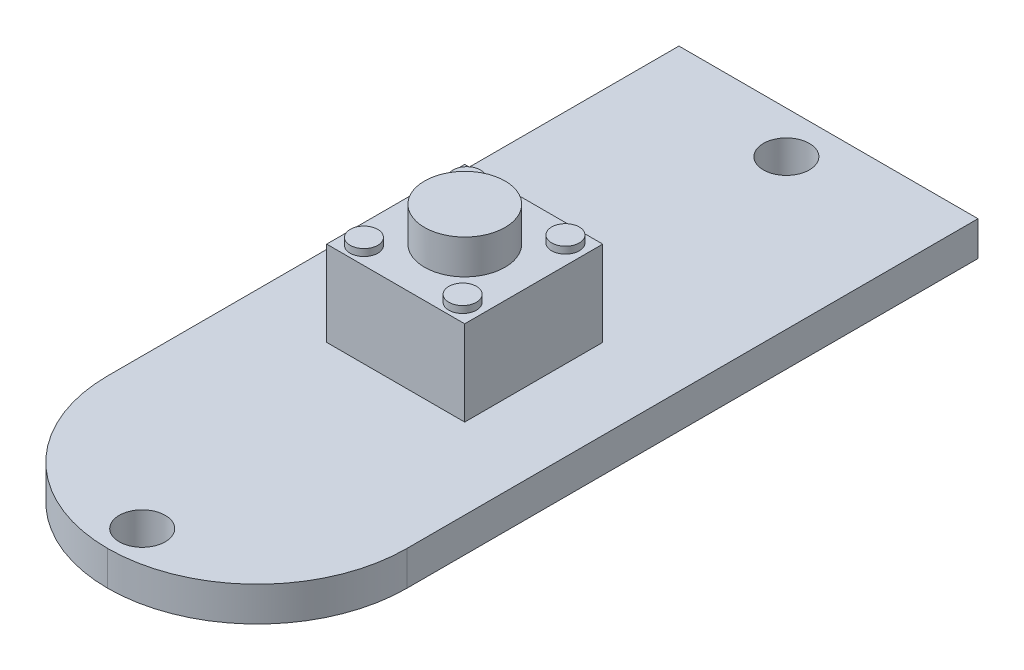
ISO-10303-21;
HEADER;
FILE_DESCRIPTION(('STEP AP214'),'2;1');
FILE_NAME('part.step','',(''),(''),'','','');
FILE_SCHEMA(('AUTOMOTIVE_DESIGN { 1 0 10303 214 1 1 1 1 }'));
ENDSEC;
DATA;
#1=APPLICATION_CONTEXT('core data for automotive mechanical design processes');
#2=APPLICATION_PROTOCOL_DEFINITION('international standard','automotive_design',2000,#1);
#3=PRODUCT_CONTEXT('',#1,'mechanical');
#4=PRODUCT('Part','Part','',(#3));
#5=PRODUCT_RELATED_PRODUCT_CATEGORY('part','',(#4));
#6=PRODUCT_DEFINITION_FORMATION('','',#4);
#7=PRODUCT_DEFINITION_CONTEXT('part definition',#1,'design');
#8=PRODUCT_DEFINITION('design','',#6,#7);
#9=PRODUCT_DEFINITION_SHAPE('','',#8);
#10=(LENGTH_UNIT() NAMED_UNIT(*) SI_UNIT(.MILLI.,.METRE.));
#11=(NAMED_UNIT(*) PLANE_ANGLE_UNIT() SI_UNIT($,.RADIAN.));
#12=(NAMED_UNIT(*) SI_UNIT($,.STERADIAN.) SOLID_ANGLE_UNIT());
#13=UNCERTAINTY_MEASURE_WITH_UNIT(LENGTH_MEASURE(1.E-05),#10,'distance_accuracy_value','');
#14=(GEOMETRIC_REPRESENTATION_CONTEXT(3) GLOBAL_UNCERTAINTY_ASSIGNED_CONTEXT((#13)) GLOBAL_UNIT_ASSIGNED_CONTEXT((#10,
#11,#12)) REPRESENTATION_CONTEXT('',''));
#15=CARTESIAN_POINT('',(0.,0.,0.));
#16=DIRECTION('',(0.,0.,1.));
#17=DIRECTION('',(1.,0.,0.));
#18=AXIS2_PLACEMENT_3D('',#15,#16,#17);
#19=CARTESIAN_POINT('',(-6.5,-0.75,5.));
#20=DIRECTION('',(0.,1.,0.));
#21=DIRECTION('',(-1.,0.,0.));
#22=AXIS2_PLACEMENT_3D('',#19,#20,#21);
#23=PLANE('',#22);
#24=CARTESIAN_POINT('',(0.,-0.75,-1.5));
#25=DIRECTION('',(0.,-1.,0.));
#26=DIRECTION('',(1.,0.,0.));
#27=AXIS2_PLACEMENT_3D('',#24,#25,#26);
#28=CIRCLE('',#27,1.);
#29=CARTESIAN_POINT('',(1.,-0.75,-1.5));
#30=VERTEX_POINT('',#29);
#31=EDGE_CURVE('E479',#30,#30,#28,.T.);
#32=ORIENTED_EDGE('',*,*,#31,.F.);
#33=EDGE_LOOP('',(#32));
#34=FACE_BOUND('',#33,.T.);
#35=CARTESIAN_POINT('',(0.,-0.75,26.5));
#36=DIRECTION('',(0.,-1.,0.));
#37=DIRECTION('',(1.,0.,0.));
#38=AXIS2_PLACEMENT_3D('',#35,#36,#37);
#39=CIRCLE('',#38,1.);
#40=CARTESIAN_POINT('',(1.,-0.75,26.5));
#41=VERTEX_POINT('',#40);
#42=EDGE_CURVE('E476',#41,#41,#39,.T.);
#43=ORIENTED_EDGE('',*,*,#42,.F.);
#44=EDGE_LOOP('',(#43));
#45=FACE_BOUND('',#44,.T.);
#46=DIRECTION('',(1.,0.,0.));
#47=VECTOR('',#46,1.);
#48=CARTESIAN_POINT('',(-2.96572435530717,-0.75,-0.126898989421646));
#49=LINE('',#48,#47);
#50=CARTESIAN_POINT('',(-2.96572435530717,-0.75,-0.126898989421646));
#51=VERTEX_POINT('',#50);
#52=CARTESIAN_POINT('',(-1.28156357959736,-0.75,-0.126898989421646));
#53=VERTEX_POINT('',#52);
#54=EDGE_CURVE('E549',#51,#53,#49,.T.);
#55=ORIENTED_EDGE('',*,*,#54,.F.);
#56=DIRECTION('',(0.,0.,-1.));
#57=VECTOR('',#56,1.);
#58=CARTESIAN_POINT('',(-2.96572435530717,-0.75,-0.126898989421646));
#59=LINE('',#58,#57);
#60=CARTESIAN_POINT('',(-2.96572435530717,-0.75,2.60417253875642));
#61=VERTEX_POINT('',#60);
#62=EDGE_CURVE('E557',#61,#51,#59,.T.);
#63=ORIENTED_EDGE('',*,*,#62,.F.);
#64=DIRECTION('',(-1.,0.,0.));
#65=VECTOR('',#64,1.);
#66=CARTESIAN_POINT('',(-2.96572435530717,-0.75,2.60417253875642));
#67=LINE('',#66,#65);
#68=CARTESIAN_POINT('',(-1.28156357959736,-0.75,2.60417253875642));
#69=VERTEX_POINT('',#68);
#70=EDGE_CURVE('E554',#69,#61,#67,.T.);
#71=ORIENTED_EDGE('',*,*,#70,.F.);
#72=DIRECTION('',(0.,0.,1.));
#73=VECTOR('',#72,1.);
#74=CARTESIAN_POINT('',(-1.28156357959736,-0.75,-0.126898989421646));
#75=LINE('',#74,#73);
#76=EDGE_CURVE('E552',#53,#69,#75,.T.);
#77=ORIENTED_EDGE('',*,*,#76,.F.);
#78=EDGE_LOOP('',(#55,#63,#71,#77));
#79=FACE_BOUND('',#78,.T.);
#80=DIRECTION('',(1.,0.,0.));
#81=VECTOR('',#80,1.);
#82=CARTESIAN_POINT('',(2.96572435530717,-0.75,-0.126898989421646));
#83=LINE('',#82,#81);
#84=CARTESIAN_POINT('',(1.28156357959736,-0.75,-0.126898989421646));
#85=VERTEX_POINT('',#84);
#86=CARTESIAN_POINT('',(2.96572435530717,-0.75,-0.126898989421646));
#87=VERTEX_POINT('',#86);
#88=EDGE_CURVE('E576',#85,#87,#83,.T.);
#89=ORIENTED_EDGE('',*,*,#88,.F.);
#90=DIRECTION('',(0.,0.,-1.));
#91=VECTOR('',#90,1.);
#92=CARTESIAN_POINT('',(1.28156357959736,-0.75,-0.126898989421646));
#93=LINE('',#92,#91);
#94=CARTESIAN_POINT('',(1.28156357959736,-0.75,2.60417253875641));
#95=VERTEX_POINT('',#94);
#96=EDGE_CURVE('E574',#95,#85,#93,.T.);
#97=ORIENTED_EDGE('',*,*,#96,.F.);
#98=DIRECTION('',(-1.,0.,0.));
#99=VECTOR('',#98,1.);
#100=CARTESIAN_POINT('',(2.96572435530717,-0.75,2.60417253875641));
#101=LINE('',#100,#99);
#102=CARTESIAN_POINT('',(2.96572435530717,-0.75,2.60417253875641));
#103=VERTEX_POINT('',#102);
#104=EDGE_CURVE('E571',#103,#95,#101,.T.);
#105=ORIENTED_EDGE('',*,*,#104,.F.);
#106=DIRECTION('',(0.,0.,1.));
#107=VECTOR('',#106,1.);
#108=CARTESIAN_POINT('',(2.96572435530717,-0.75,-0.126898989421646));
#109=LINE('',#108,#107);
#110=EDGE_CURVE('E569',#87,#103,#109,.T.);
#111=ORIENTED_EDGE('',*,*,#110,.F.);
#112=EDGE_LOOP('',(#89,#97,#105,#111));
#113=FACE_BOUND('',#112,.T.);
#114=DIRECTION('',(0.,0.,1.));
#115=VECTOR('',#114,1.);
#116=CARTESIAN_POINT('',(2.96572435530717,-0.75,9.0269525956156));
#117=LINE('',#116,#115);
#118=CARTESIAN_POINT('',(2.96572435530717,-0.75,9.0269525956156));
#119=VERTEX_POINT('',#118);
#120=CARTESIAN_POINT('',(2.96572435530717,-0.75,11.7580241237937));
#121=VERTEX_POINT('',#120);
#122=EDGE_CURVE('E609',#119,#121,#117,.T.);
#123=ORIENTED_EDGE('',*,*,#122,.F.);
#124=DIRECTION('',(1.,0.,0.));
#125=VECTOR('',#124,1.);
#126=CARTESIAN_POINT('',(2.96572435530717,-0.75,9.0269525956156));
#127=LINE('',#126,#125);
#128=CARTESIAN_POINT('',(1.28156357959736,-0.75,9.0269525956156));
#129=VERTEX_POINT('',#128);
#130=EDGE_CURVE('E618',#129,#119,#127,.T.);
#131=ORIENTED_EDGE('',*,*,#130,.F.);
#132=DIRECTION('',(0.,0.,-1.));
#133=VECTOR('',#132,1.);
#134=CARTESIAN_POINT('',(1.28156357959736,-0.75,9.0269525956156));
#135=LINE('',#134,#133);
#136=CARTESIAN_POINT('',(1.28156357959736,-0.75,11.7580241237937));
#137=VERTEX_POINT('',#136);
#138=EDGE_CURVE('E615',#137,#129,#135,.T.);
#139=ORIENTED_EDGE('',*,*,#138,.F.);
#140=DIRECTION('',(-1.,0.,0.));
#141=VECTOR('',#140,1.);
#142=CARTESIAN_POINT('',(2.96572435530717,-0.75,11.7580241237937));
#143=LINE('',#142,#141);
#144=EDGE_CURVE('E612',#121,#137,#143,.T.);
#145=ORIENTED_EDGE('',*,*,#144,.F.);
#146=EDGE_LOOP('',(#123,#131,#139,#145));
#147=FACE_BOUND('',#146,.T.);
#148=DIRECTION('',(0.,0.,-1.));
#149=VECTOR('',#148,1.);
#150=CARTESIAN_POINT('',(-2.96572435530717,-0.75,16.0387529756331));
#151=LINE('',#150,#149);
#152=CARTESIAN_POINT('',(-2.96572435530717,-0.75,16.0387529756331));
#153=VERTEX_POINT('',#152);
#154=CARTESIAN_POINT('',(-2.96572435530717,-0.75,13.307681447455));
#155=VERTEX_POINT('',#154);
#156=EDGE_CURVE('E649',#153,#155,#151,.T.);
#157=ORIENTED_EDGE('',*,*,#156,.F.);
#158=DIRECTION('',(-1.,0.,0.));
#159=VECTOR('',#158,1.);
#160=CARTESIAN_POINT('',(-2.96572435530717,-0.75,16.0387529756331));
#161=LINE('',#160,#159);
#162=CARTESIAN_POINT('',(-1.28156357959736,-0.75,16.0387529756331));
#163=VERTEX_POINT('',#162);
#164=EDGE_CURVE('E658',#163,#153,#161,.T.);
#165=ORIENTED_EDGE('',*,*,#164,.F.);
#166=DIRECTION('',(0.,0.,1.));
#167=VECTOR('',#166,1.);
#168=CARTESIAN_POINT('',(-1.28156357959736,-0.75,16.0387529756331));
#169=LINE('',#168,#167);
#170=CARTESIAN_POINT('',(-1.28156357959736,-0.75,13.307681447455));
#171=VERTEX_POINT('',#170);
#172=EDGE_CURVE('E655',#171,#163,#169,.T.);
#173=ORIENTED_EDGE('',*,*,#172,.F.);
#174=DIRECTION('',(1.,0.,0.));
#175=VECTOR('',#174,1.);
#176=CARTESIAN_POINT('',(-2.96572435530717,-0.75,13.307681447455));
#177=LINE('',#176,#175);
#178=EDGE_CURVE('E652',#155,#171,#177,.T.);
#179=ORIENTED_EDGE('',*,*,#178,.F.);
#180=EDGE_LOOP('',(#157,#165,#173,#179));
#181=FACE_BOUND('',#180,.T.);
#182=DIRECTION('',(-1.,0.,0.));
#183=VECTOR('',#182,1.);
#184=CARTESIAN_POINT('',(2.96572435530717,-0.75,16.0387529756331));
#185=LINE('',#184,#183);
#186=CARTESIAN_POINT('',(2.96572435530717,-0.75,16.0387529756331));
#187=VERTEX_POINT('',#186);
#188=CARTESIAN_POINT('',(1.28156357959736,-0.75,16.0387529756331));
#189=VERTEX_POINT('',#188);
#190=EDGE_CURVE('E629',#187,#189,#185,.T.);
#191=ORIENTED_EDGE('',*,*,#190,.F.);
#192=DIRECTION('',(0.,0.,1.));
#193=VECTOR('',#192,1.);
#194=CARTESIAN_POINT('',(2.96572435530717,-0.75,16.0387529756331));
#195=LINE('',#194,#193);
#196=CARTESIAN_POINT('',(2.96572435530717,-0.75,13.307681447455));
#197=VERTEX_POINT('',#196);
#198=EDGE_CURVE('E638',#197,#187,#195,.T.);
#199=ORIENTED_EDGE('',*,*,#198,.F.);
#200=DIRECTION('',(1.,0.,0.));
#201=VECTOR('',#200,1.);
#202=CARTESIAN_POINT('',(2.96572435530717,-0.75,13.307681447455));
#203=LINE('',#202,#201);
#204=CARTESIAN_POINT('',(1.28156357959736,-0.75,13.307681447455));
#205=VERTEX_POINT('',#204);
#206=EDGE_CURVE('E635',#205,#197,#203,.T.);
#207=ORIENTED_EDGE('',*,*,#206,.F.);
#208=DIRECTION('',(0.,0.,-1.));
#209=VECTOR('',#208,1.);
#210=CARTESIAN_POINT('',(1.28156357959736,-0.75,16.0387529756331));
#211=LINE('',#210,#209);
#212=EDGE_CURVE('E632',#189,#205,#211,.T.);
#213=ORIENTED_EDGE('',*,*,#212,.F.);
#214=EDGE_LOOP('',(#191,#199,#207,#213));
#215=FACE_BOUND('',#214,.T.);
#216=DIRECTION('',(1.,0.,0.));
#217=VECTOR('',#216,1.);
#218=CARTESIAN_POINT('',(-2.96572435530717,-0.75,9.0269525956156));
#219=LINE('',#218,#217);
#220=CARTESIAN_POINT('',(-2.96572435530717,-0.75,9.0269525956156));
#221=VERTEX_POINT('',#220);
#222=CARTESIAN_POINT('',(-1.28156357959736,-0.75,9.0269525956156));
#223=VERTEX_POINT('',#222);
#224=EDGE_CURVE('E589',#221,#223,#219,.T.);
#225=ORIENTED_EDGE('',*,*,#224,.F.);
#226=DIRECTION('',(0.,0.,-1.));
#227=VECTOR('',#226,1.);
#228=CARTESIAN_POINT('',(-2.96572435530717,-0.75,9.0269525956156));
#229=LINE('',#228,#227);
#230=CARTESIAN_POINT('',(-2.96572435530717,-0.75,11.7580241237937));
#231=VERTEX_POINT('',#230);
#232=EDGE_CURVE('E598',#231,#221,#229,.T.);
#233=ORIENTED_EDGE('',*,*,#232,.F.);
#234=DIRECTION('',(-1.,0.,0.));
#235=VECTOR('',#234,1.);
#236=CARTESIAN_POINT('',(-2.96572435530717,-0.75,11.7580241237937));
#237=LINE('',#236,#235);
#238=CARTESIAN_POINT('',(-1.28156357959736,-0.75,11.7580241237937));
#239=VERTEX_POINT('',#238);
#240=EDGE_CURVE('E595',#239,#231,#237,.T.);
#241=ORIENTED_EDGE('',*,*,#240,.F.);
#242=DIRECTION('',(0.,0.,1.));
#243=VECTOR('',#242,1.);
#244=CARTESIAN_POINT('',(-1.28156357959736,-0.75,9.0269525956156));
#245=LINE('',#244,#243);
#246=EDGE_CURVE('E592',#223,#239,#245,.T.);
#247=ORIENTED_EDGE('',*,*,#246,.F.);
#248=EDGE_LOOP('',(#225,#233,#241,#247));
#249=FACE_BOUND('',#248,.T.);
#250=DIRECTION('',(0.,0.,-1.));
#251=VECTOR('',#250,1.);
#252=CARTESIAN_POINT('',(-6.5,-0.75,5.));
#253=LINE('',#252,#251);
#254=CARTESIAN_POINT('',(-6.5,-0.75,21.5));
#255=VERTEX_POINT('',#254);
#256=CARTESIAN_POINT('',(-6.5,-0.75,-3.32918139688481));
#257=VERTEX_POINT('',#256);
#258=EDGE_CURVE('E316',#255,#257,#253,.T.);
#259=ORIENTED_EDGE('',*,*,#258,.T.);
#260=DIRECTION('',(-1.,0.,0.));
#261=VECTOR('',#260,1.);
#262=CARTESIAN_POINT('',(-11.539403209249,-0.75,-3.32918139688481));
#263=LINE('',#262,#261);
#264=CARTESIAN_POINT('',(6.5,-0.75,-3.32918139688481));
#265=VERTEX_POINT('',#264);
#266=EDGE_CURVE('E304',#265,#257,#263,.T.);
#267=ORIENTED_EDGE('',*,*,#266,.F.);
#268=DIRECTION('',(0.,0.,-1.));
#269=VECTOR('',#268,1.);
#270=CARTESIAN_POINT('',(6.5,-0.75,5.));
#271=LINE('',#270,#269);
#272=CARTESIAN_POINT('',(6.5,-0.75,21.5));
#273=VERTEX_POINT('',#272);
#274=EDGE_CURVE('E313',#273,#265,#271,.T.);
#275=ORIENTED_EDGE('',*,*,#274,.F.);
#276=CARTESIAN_POINT('',(0.,-0.75,21.5));
#277=DIRECTION('',(0.,1.,0.));
#278=DIRECTION('',(-1.,0.,0.));
#279=AXIS2_PLACEMENT_3D('',#276,#277,#278);
#280=CIRCLE('',#279,6.5);
#281=CARTESIAN_POINT('',(0.,-0.75,28.));
#282=VERTEX_POINT('',#281);
#283=EDGE_CURVE('E362',#273,#282,#280,.F.);
#284=ORIENTED_EDGE('',*,*,#283,.T.);
#285=CARTESIAN_POINT('',(0.,-0.75,21.5));
#286=DIRECTION('',(0.,1.,0.));
#287=DIRECTION('',(-1.,0.,0.));
#288=AXIS2_PLACEMENT_3D('',#285,#286,#287);
#289=CIRCLE('',#288,6.5);
#290=EDGE_CURVE('E364',#282,#255,#289,.F.);
#291=ORIENTED_EDGE('',*,*,#290,.T.);
#292=EDGE_LOOP('',(#259,#267,#275,#284,#291));
#293=FACE_BOUND('',#292,.T.);
#294=ADVANCED_FACE('F16',(#34,#45,#79,#113,#147,#181,#215,#249,#293),#23,.F.);
#295=CARTESIAN_POINT('',(3.,4.45,9.48268097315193));
#296=DIRECTION('',(0.,-1.,0.));
#297=DIRECTION('',(1.,0.,0.));
#298=AXIS2_PLACEMENT_3D('',#295,#296,#297);
#299=PLANE('',#298);
#300=CARTESIAN_POINT('',(-2.14472255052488,4.45,10.2478398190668));
#301=DIRECTION('',(0.,-1.,0.));
#302=DIRECTION('',(1.,0.,0.));
#303=AXIS2_PLACEMENT_3D('',#300,#301,#302);
#304=CIRCLE('',#303,0.6);
#305=CARTESIAN_POINT('',(-1.54472255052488,4.45,10.2478398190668));
#306=VERTEX_POINT('',#305);
#307=EDGE_CURVE('E349',#306,#306,#304,.F.);
#308=ORIENTED_EDGE('',*,*,#307,.F.);
#309=EDGE_LOOP('',(#308));
#310=FACE_BOUND('',#309,.T.);
#311=CARTESIAN_POINT('',(2.14472255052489,4.45,14.717522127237));
#312=DIRECTION('',(0.,-1.,0.));
#313=DIRECTION('',(1.,0.,0.));
#314=AXIS2_PLACEMENT_3D('',#311,#312,#313);
#315=CIRCLE('',#314,0.6);
#316=CARTESIAN_POINT('',(2.74472255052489,4.45,14.717522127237));
#317=VERTEX_POINT('',#316);
#318=EDGE_CURVE('E343',#317,#317,#315,.F.);
#319=ORIENTED_EDGE('',*,*,#318,.F.);
#320=EDGE_LOOP('',(#319));
#321=FACE_BOUND('',#320,.T.);
#322=DIRECTION('',(1.,0.,0.));
#323=VECTOR('',#322,1.);
#324=CARTESIAN_POINT('',(-3.,4.45,9.48268097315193));
#325=LINE('',#324,#323);
#326=CARTESIAN_POINT('',(-3.,4.45,9.48268097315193));
#327=VERTEX_POINT('',#326);
#328=CARTESIAN_POINT('',(3.,4.45,9.48268097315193));
#329=VERTEX_POINT('',#328);
#330=EDGE_CURVE('E687',#327,#329,#325,.T.);
#331=ORIENTED_EDGE('',*,*,#330,.F.);
#332=DIRECTION('',(0.,0.,-1.));
#333=VECTOR('',#332,1.);
#334=CARTESIAN_POINT('',(-3.,4.45,15.482680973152));
#335=LINE('',#334,#333);
#336=CARTESIAN_POINT('',(-3.,4.45,15.482680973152));
#337=VERTEX_POINT('',#336);
#338=EDGE_CURVE('E696',#337,#327,#335,.T.);
#339=ORIENTED_EDGE('',*,*,#338,.F.);
#340=DIRECTION('',(-1.,0.,0.));
#341=VECTOR('',#340,1.);
#342=CARTESIAN_POINT('',(3.,4.45,15.482680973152));
#343=LINE('',#342,#341);
#344=CARTESIAN_POINT('',(3.,4.45,15.482680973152));
#345=VERTEX_POINT('',#344);
#346=EDGE_CURVE('E693',#345,#337,#343,.T.);
#347=ORIENTED_EDGE('',*,*,#346,.F.);
#348=DIRECTION('',(0.,0.,1.));
#349=VECTOR('',#348,1.);
#350=CARTESIAN_POINT('',(3.,4.45,9.48268097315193));
#351=LINE('',#350,#349);
#352=EDGE_CURVE('E690',#329,#345,#351,.T.);
#353=ORIENTED_EDGE('',*,*,#352,.F.);
#354=EDGE_LOOP('',(#331,#339,#347,#353));
#355=FACE_BOUND('',#354,.T.);
#356=CARTESIAN_POINT('',(0.,4.45,12.4784922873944));
#357=DIRECTION('',(0.,-1.,0.));
#358=DIRECTION('',(1.,0.,0.));
#359=AXIS2_PLACEMENT_3D('',#356,#357,#358);
#360=CIRCLE('',#359,1.75);
#361=CARTESIAN_POINT('',(1.75,4.45,12.4784922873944));
#362=VERTEX_POINT('',#361);
#363=EDGE_CURVE('E340',#362,#362,#360,.F.);
#364=ORIENTED_EDGE('',*,*,#363,.F.);
#365=EDGE_LOOP('',(#364));
#366=FACE_BOUND('',#365,.T.);
#367=CARTESIAN_POINT('',(-2.14472255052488,4.45,14.717522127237));
#368=DIRECTION('',(0.,-1.,0.));
#369=DIRECTION('',(1.,0.,0.));
#370=AXIS2_PLACEMENT_3D('',#367,#368,#369);
#371=CIRCLE('',#370,0.6);
#372=CARTESIAN_POINT('',(-1.54472255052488,4.45,14.717522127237));
#373=VERTEX_POINT('',#372);
#374=EDGE_CURVE('E346',#373,#373,#371,.F.);
#375=ORIENTED_EDGE('',*,*,#374,.F.);
#376=EDGE_LOOP('',(#375));
#377=FACE_BOUND('',#376,.T.);
#378=CARTESIAN_POINT('',(2.14472255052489,4.45,10.2478398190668));
#379=DIRECTION('',(0.,-1.,0.));
#380=DIRECTION('',(1.,0.,0.));
#381=AXIS2_PLACEMENT_3D('',#378,#379,#380);
#382=CIRCLE('',#381,0.6);
#383=CARTESIAN_POINT('',(2.74472255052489,4.45,10.2478398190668));
#384=VERTEX_POINT('',#383);
#385=EDGE_CURVE('E352',#384,#384,#382,.F.);
#386=ORIENTED_EDGE('',*,*,#385,.F.);
#387=EDGE_LOOP('',(#386));
#388=FACE_BOUND('',#387,.T.);
#389=ADVANCED_FACE('F737',(#310,#321,#355,#366,#377,#388),#299,.F.);
#390=CARTESIAN_POINT('',(-6.5,0.75,5.));
#391=DIRECTION('',(1.,0.,0.));
#392=DIRECTION('',(0.,0.,-1.));
#393=AXIS2_PLACEMENT_3D('',#390,#391,#392);
#394=PLANE('',#393);
#395=DIRECTION('',(0.,0.,-1.));
#396=VECTOR('',#395,1.);
#397=CARTESIAN_POINT('',(-6.5,0.75,5.));
#398=LINE('',#397,#396);
#399=CARTESIAN_POINT('',(-6.5,0.75,21.5));
#400=VERTEX_POINT('',#399);
#401=CARTESIAN_POINT('',(-6.5,0.75,-3.32918139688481));
#402=VERTEX_POINT('',#401);
#403=EDGE_CURVE('E325',#400,#402,#398,.T.);
#404=ORIENTED_EDGE('',*,*,#403,.T.);
#405=DIRECTION('',(0.,-1.,0.));
#406=VECTOR('',#405,1.);
#407=CARTESIAN_POINT('',(-6.5,0.75,-3.32918139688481));
#408=LINE('',#407,#406);
#409=EDGE_CURVE('E31',#402,#257,#408,.T.);
#410=ORIENTED_EDGE('',*,*,#409,.T.);
#411=ORIENTED_EDGE('',*,*,#258,.F.);
#412=DIRECTION('',(0.,1.,0.));
#413=VECTOR('',#412,1.);
#414=CARTESIAN_POINT('',(-6.5,0.75,21.5));
#415=LINE('',#414,#413);
#416=EDGE_CURVE('E355',#255,#400,#415,.T.);
#417=ORIENTED_EDGE('',*,*,#416,.T.);
#418=EDGE_LOOP('',(#404,#410,#411,#417));
#419=FACE_BOUND('',#418,.T.);
#420=ADVANCED_FACE('F18',(#419),#394,.F.);
#421=CARTESIAN_POINT('',(6.5,0.75,5.));
#422=DIRECTION('',(-1.,0.,0.));
#423=DIRECTION('',(0.,0.,1.));
#424=AXIS2_PLACEMENT_3D('',#421,#422,#423);
#425=PLANE('',#424);
#426=ORIENTED_EDGE('',*,*,#274,.T.);
#427=DIRECTION('',(0.,1.,0.));
#428=VECTOR('',#427,1.);
#429=CARTESIAN_POINT('',(6.5,0.75,-3.32918139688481));
#430=LINE('',#429,#428);
#431=CARTESIAN_POINT('',(6.5,0.75,-3.32918139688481));
#432=VERTEX_POINT('',#431);
#433=EDGE_CURVE('E301',#265,#432,#430,.T.);
#434=ORIENTED_EDGE('',*,*,#433,.T.);
#435=DIRECTION('',(0.,0.,-1.));
#436=VECTOR('',#435,1.);
#437=CARTESIAN_POINT('',(6.5,0.75,5.));
#438=LINE('',#437,#436);
#439=CARTESIAN_POINT('',(6.5,0.75,21.5));
#440=VERTEX_POINT('',#439);
#441=EDGE_CURVE('E321',#440,#432,#438,.T.);
#442=ORIENTED_EDGE('',*,*,#441,.F.);
#443=DIRECTION('',(0.,1.,0.));
#444=VECTOR('',#443,1.);
#445=CARTESIAN_POINT('',(6.5,-0.75,21.5));
#446=LINE('',#445,#444);
#447=EDGE_CURVE('E320',#440,#273,#446,.F.);
#448=ORIENTED_EDGE('',*,*,#447,.T.);
#449=EDGE_LOOP('',(#426,#434,#442,#448));
#450=FACE_BOUND('',#449,.T.);
#451=ADVANCED_FACE('F318',(#450),#425,.F.);
#452=CARTESIAN_POINT('',(-6.5,0.75,5.));
#453=DIRECTION('',(0.,-1.,0.));
#454=DIRECTION('',(1.,0.,0.));
#455=AXIS2_PLACEMENT_3D('',#452,#453,#454);
#456=PLANE('',#455);
#457=CARTESIAN_POINT('',(0.,0.75,-1.5));
#458=DIRECTION('',(0.,-1.,0.));
#459=DIRECTION('',(1.,0.,0.));
#460=AXIS2_PLACEMENT_3D('',#457,#458,#459);
#461=CIRCLE('',#460,1.);
#462=CARTESIAN_POINT('',(1.,0.75,-1.5));
#463=VERTEX_POINT('',#462);
#464=EDGE_CURVE('E477',#463,#463,#461,.T.);
#465=ORIENTED_EDGE('',*,*,#464,.T.);
#466=EDGE_LOOP('',(#465));
#467=FACE_BOUND('',#466,.T.);
#468=CARTESIAN_POINT('',(0.,0.75,26.5));
#469=DIRECTION('',(0.,-1.,0.));
#470=DIRECTION('',(1.,0.,0.));
#471=AXIS2_PLACEMENT_3D('',#468,#469,#470);
#472=CIRCLE('',#471,1.);
#473=CARTESIAN_POINT('',(1.,0.75,26.5));
#474=VERTEX_POINT('',#473);
#475=EDGE_CURVE('E473',#474,#474,#472,.T.);
#476=ORIENTED_EDGE('',*,*,#475,.T.);
#477=EDGE_LOOP('',(#476));
#478=FACE_BOUND('',#477,.T.);
#479=ORIENTED_EDGE('',*,*,#441,.T.);
#480=DIRECTION('',(-1.,0.,0.));
#481=VECTOR('',#480,1.);
#482=CARTESIAN_POINT('',(-6.5,0.75,-3.32918139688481));
#483=LINE('',#482,#481);
#484=EDGE_CURVE('E11',#432,#402,#483,.T.);
#485=ORIENTED_EDGE('',*,*,#484,.T.);
#486=ORIENTED_EDGE('',*,*,#403,.F.);
#487=CARTESIAN_POINT('',(0.,0.75,21.5));
#488=DIRECTION('',(0.,-1.,0.));
#489=DIRECTION('',(1.,0.,0.));
#490=AXIS2_PLACEMENT_3D('',#487,#488,#489);
#491=CIRCLE('',#490,6.5);
#492=CARTESIAN_POINT('',(0.,0.75,28.));
#493=VERTEX_POINT('',#492);
#494=EDGE_CURVE('E360',#400,#493,#491,.F.);
#495=ORIENTED_EDGE('',*,*,#494,.T.);
#496=CARTESIAN_POINT('',(0.,0.75,21.5));
#497=DIRECTION('',(0.,-1.,0.));
#498=DIRECTION('',(1.,0.,0.));
#499=AXIS2_PLACEMENT_3D('',#496,#497,#498);
#500=CIRCLE('',#499,6.5);
#501=EDGE_CURVE('E358',#493,#440,#500,.F.);
#502=ORIENTED_EDGE('',*,*,#501,.T.);
#503=EDGE_LOOP('',(#479,#485,#486,#495,#502));
#504=FACE_BOUND('',#503,.T.);
#505=DIRECTION('',(0.,0.,-1.));
#506=VECTOR('',#505,1.);
#507=CARTESIAN_POINT('',(-3.,0.75,5.));
#508=LINE('',#507,#506);
#509=CARTESIAN_POINT('',(-3.,0.75,15.482680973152));
#510=VERTEX_POINT('',#509);
#511=CARTESIAN_POINT('',(-3.,0.75,9.48268097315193));
#512=VERTEX_POINT('',#511);
#513=EDGE_CURVE('E334',#510,#512,#508,.T.);
#514=ORIENTED_EDGE('',*,*,#513,.T.);
#515=DIRECTION('',(1.,0.,0.));
#516=VECTOR('',#515,1.);
#517=CARTESIAN_POINT('',(-6.5,0.75,9.48268097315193));
#518=LINE('',#517,#516);
#519=CARTESIAN_POINT('',(3.,0.75,9.48268097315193));
#520=VERTEX_POINT('',#519);
#521=EDGE_CURVE('E337',#512,#520,#518,.T.);
#522=ORIENTED_EDGE('',*,*,#521,.T.);
#523=DIRECTION('',(0.,0.,1.));
#524=VECTOR('',#523,1.);
#525=CARTESIAN_POINT('',(3.,0.75,5.));
#526=LINE('',#525,#524);
#527=CARTESIAN_POINT('',(3.,0.75,15.482680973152));
#528=VERTEX_POINT('',#527);
#529=EDGE_CURVE('E323',#520,#528,#526,.T.);
#530=ORIENTED_EDGE('',*,*,#529,.T.);
#531=DIRECTION('',(-1.,0.,0.));
#532=VECTOR('',#531,1.);
#533=CARTESIAN_POINT('',(-6.5,0.75,15.482680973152));
#534=LINE('',#533,#532);
#535=EDGE_CURVE('E331',#528,#510,#534,.T.);
#536=ORIENTED_EDGE('',*,*,#535,.T.);
#537=EDGE_LOOP('',(#514,#522,#530,#536));
#538=FACE_BOUND('',#537,.T.);
#539=ADVANCED_FACE('F714',(#467,#478,#504,#538),#456,.F.);
#540=CARTESIAN_POINT('',(-3.,4.45,9.48268097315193));
#541=DIRECTION('',(0.,0.,-1.));
#542=DIRECTION('',(-1.,0.,0.));
#543=AXIS2_PLACEMENT_3D('',#540,#541,#542);
#544=PLANE('',#543);
#545=ORIENTED_EDGE('',*,*,#521,.F.);
#546=DIRECTION('',(0.,-1.,0.));
#547=VECTOR('',#546,1.);
#548=CARTESIAN_POINT('',(-3.,4.45,9.48268097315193));
#549=LINE('',#548,#547);
#550=EDGE_CURVE('E700',#327,#512,#549,.T.);
#551=ORIENTED_EDGE('',*,*,#550,.F.);
#552=ORIENTED_EDGE('',*,*,#330,.T.);
#553=DIRECTION('',(0.,-1.,0.));
#554=VECTOR('',#553,1.);
#555=CARTESIAN_POINT('',(3.,4.45,9.48268097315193));
#556=LINE('',#555,#554);
#557=EDGE_CURVE('E699',#329,#520,#556,.T.);
#558=ORIENTED_EDGE('',*,*,#557,.T.);
#559=EDGE_LOOP('',(#545,#551,#552,#558));
#560=FACE_BOUND('',#559,.T.);
#561=ADVANCED_FACE('F750',(#560),#544,.T.);
#562=CARTESIAN_POINT('',(-3.,4.45,15.482680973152));
#563=DIRECTION('',(-1.,0.,0.));
#564=DIRECTION('',(0.,0.,1.));
#565=AXIS2_PLACEMENT_3D('',#562,#563,#564);
#566=PLANE('',#565);
#567=ORIENTED_EDGE('',*,*,#513,.F.);
#568=DIRECTION('',(0.,-1.,0.));
#569=VECTOR('',#568,1.);
#570=CARTESIAN_POINT('',(-3.,4.45,15.482680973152));
#571=LINE('',#570,#569);
#572=EDGE_CURVE('E703',#337,#510,#571,.T.);
#573=ORIENTED_EDGE('',*,*,#572,.F.);
#574=ORIENTED_EDGE('',*,*,#338,.T.);
#575=ORIENTED_EDGE('',*,*,#550,.T.);
#576=EDGE_LOOP('',(#567,#573,#574,#575));
#577=FACE_BOUND('',#576,.T.);
#578=ADVANCED_FACE('F753',(#577),#566,.T.);
#579=CARTESIAN_POINT('',(3.,4.45,15.482680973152));
#580=DIRECTION('',(0.,0.,1.));
#581=DIRECTION('',(1.,0.,0.));
#582=AXIS2_PLACEMENT_3D('',#579,#580,#581);
#583=PLANE('',#582);
#584=ORIENTED_EDGE('',*,*,#535,.F.);
#585=DIRECTION('',(0.,-1.,0.));
#586=VECTOR('',#585,1.);
#587=CARTESIAN_POINT('',(3.,4.45,15.482680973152));
#588=LINE('',#587,#586);
#589=EDGE_CURVE('E706',#345,#528,#588,.T.);
#590=ORIENTED_EDGE('',*,*,#589,.F.);
#591=ORIENTED_EDGE('',*,*,#346,.T.);
#592=ORIENTED_EDGE('',*,*,#572,.T.);
#593=EDGE_LOOP('',(#584,#590,#591,#592));
#594=FACE_BOUND('',#593,.T.);
#595=ADVANCED_FACE('F759',(#594),#583,.T.);
#596=CARTESIAN_POINT('',(3.,4.45,9.48268097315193));
#597=DIRECTION('',(1.,0.,0.));
#598=DIRECTION('',(0.,0.,-1.));
#599=AXIS2_PLACEMENT_3D('',#596,#597,#598);
#600=PLANE('',#599);
#601=ORIENTED_EDGE('',*,*,#529,.F.);
#602=ORIENTED_EDGE('',*,*,#557,.F.);
#603=ORIENTED_EDGE('',*,*,#352,.T.);
#604=ORIENTED_EDGE('',*,*,#589,.T.);
#605=EDGE_LOOP('',(#601,#602,#603,#604));
#606=FACE_BOUND('',#605,.T.);
#607=ADVANCED_FACE('F755',(#606),#600,.T.);
#608=CARTESIAN_POINT('',(0.,5.95,12.4784922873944));
#609=DIRECTION('',(0.,-1.,0.));
#610=DIRECTION('',(1.,0.,0.));
#611=AXIS2_PLACEMENT_3D('',#608,#609,#610);
#612=CYLINDRICAL_SURFACE('',#611,1.75);
#613=CARTESIAN_POINT('',(0.,5.95,12.4784922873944));
#614=DIRECTION('',(0.,1.,0.));
#615=DIRECTION('',(-1.,0.,0.));
#616=AXIS2_PLACEMENT_3D('',#613,#614,#615);
#617=CIRCLE('',#616,1.75);
#618=CARTESIAN_POINT('',(-1.75,5.95,12.4784922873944));
#619=VERTEX_POINT('',#618);
#620=EDGE_CURVE('E684',#619,#619,#617,.T.);
#621=ORIENTED_EDGE('',*,*,#620,.F.);
#622=EDGE_LOOP('',(#621));
#623=FACE_BOUND('',#622,.T.);
#624=ORIENTED_EDGE('',*,*,#363,.T.);
#625=EDGE_LOOP('',(#624));
#626=FACE_BOUND('',#625,.T.);
#627=ADVANCED_FACE('F758',(#623,#626),#612,.T.);
#628=CARTESIAN_POINT('',(0.,5.95,12.4784922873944));
#629=DIRECTION('',(0.,1.,0.));
#630=DIRECTION('',(-1.,0.,0.));
#631=AXIS2_PLACEMENT_3D('',#628,#629,#630);
#632=PLANE('',#631);
#633=ORIENTED_EDGE('',*,*,#620,.T.);
#634=EDGE_LOOP('',(#633));
#635=FACE_BOUND('',#634,.T.);
#636=ADVANCED_FACE('F769',(#635),#632,.T.);
#637=CARTESIAN_POINT('',(2.14472255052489,4.75,14.717522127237));
#638=DIRECTION('',(0.,-1.,0.));
#639=DIRECTION('',(1.,0.,0.));
#640=AXIS2_PLACEMENT_3D('',#637,#638,#639);
#641=CYLINDRICAL_SURFACE('',#640,0.6);
#642=CARTESIAN_POINT('',(2.14472255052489,4.75,14.717522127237));
#643=DIRECTION('',(0.,1.,0.));
#644=DIRECTION('',(-1.,0.,0.));
#645=AXIS2_PLACEMENT_3D('',#642,#643,#644);
#646=CIRCLE('',#645,0.6);
#647=CARTESIAN_POINT('',(1.54472255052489,4.75,14.717522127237));
#648=VERTEX_POINT('',#647);
#649=EDGE_CURVE('E681',#648,#648,#646,.T.);
#650=ORIENTED_EDGE('',*,*,#649,.F.);
#651=EDGE_LOOP('',(#650));
#652=FACE_BOUND('',#651,.T.);
#653=ORIENTED_EDGE('',*,*,#318,.T.);
#654=EDGE_LOOP('',(#653));
#655=FACE_BOUND('',#654,.T.);
#656=ADVANCED_FACE('F773',(#652,#655),#641,.T.);
#657=CARTESIAN_POINT('',(2.14472255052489,4.75,14.717522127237));
#658=DIRECTION('',(0.,1.,0.));
#659=DIRECTION('',(-1.,0.,0.));
#660=AXIS2_PLACEMENT_3D('',#657,#658,#659);
#661=PLANE('',#660);
#662=ORIENTED_EDGE('',*,*,#649,.T.);
#663=EDGE_LOOP('',(#662));
#664=FACE_BOUND('',#663,.T.);
#665=ADVANCED_FACE('F777',(#664),#661,.T.);
#666=CARTESIAN_POINT('',(-2.14472255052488,4.75,14.717522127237));
#667=DIRECTION('',(0.,-1.,0.));
#668=DIRECTION('',(1.,0.,0.));
#669=AXIS2_PLACEMENT_3D('',#666,#667,#668);
#670=CYLINDRICAL_SURFACE('',#669,0.6);
#671=CARTESIAN_POINT('',(-2.14472255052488,4.75,14.717522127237));
#672=DIRECTION('',(0.,1.,0.));
#673=DIRECTION('',(1.,0.,0.));
#674=AXIS2_PLACEMENT_3D('',#671,#672,#673);
#675=CIRCLE('',#674,0.6);
#676=CARTESIAN_POINT('',(-1.54472255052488,4.75,14.717522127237));
#677=VERTEX_POINT('',#676);
#678=EDGE_CURVE('E678',#677,#677,#675,.T.);
#679=ORIENTED_EDGE('',*,*,#678,.F.);
#680=EDGE_LOOP('',(#679));
#681=FACE_BOUND('',#680,.T.);
#682=ORIENTED_EDGE('',*,*,#374,.T.);
#683=EDGE_LOOP('',(#682));
#684=FACE_BOUND('',#683,.T.);
#685=ADVANCED_FACE('F781',(#681,#684),#670,.T.);
#686=CARTESIAN_POINT('',(-2.14472255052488,4.75,14.717522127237));
#687=DIRECTION('',(0.,-1.,0.));
#688=DIRECTION('',(1.,0.,0.));
#689=AXIS2_PLACEMENT_3D('',#686,#687,#688);
#690=PLANE('',#689);
#691=ORIENTED_EDGE('',*,*,#678,.T.);
#692=EDGE_LOOP('',(#691));
#693=FACE_BOUND('',#692,.T.);
#694=ADVANCED_FACE('F785',(#693),#690,.F.);
#695=CARTESIAN_POINT('',(-2.14472255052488,4.75,10.2478398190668));
#696=DIRECTION('',(0.,-1.,0.));
#697=DIRECTION('',(1.,0.,0.));
#698=AXIS2_PLACEMENT_3D('',#695,#696,#697);
#699=CYLINDRICAL_SURFACE('',#698,0.6);
#700=CARTESIAN_POINT('',(-2.14472255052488,4.75,10.2478398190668));
#701=DIRECTION('',(0.,1.,0.));
#702=DIRECTION('',(-1.,0.,0.));
#703=AXIS2_PLACEMENT_3D('',#700,#701,#702);
#704=CIRCLE('',#703,0.6);
#705=CARTESIAN_POINT('',(-2.74472255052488,4.75,10.2478398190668));
#706=VERTEX_POINT('',#705);
#707=EDGE_CURVE('E675',#706,#706,#704,.T.);
#708=ORIENTED_EDGE('',*,*,#707,.F.);
#709=EDGE_LOOP('',(#708));
#710=FACE_BOUND('',#709,.T.);
#711=ORIENTED_EDGE('',*,*,#307,.T.);
#712=EDGE_LOOP('',(#711));
#713=FACE_BOUND('',#712,.T.);
#714=ADVANCED_FACE('F789',(#710,#713),#699,.T.);
#715=CARTESIAN_POINT('',(-2.14472255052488,4.75,10.2478398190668));
#716=DIRECTION('',(0.,1.,0.));
#717=DIRECTION('',(-1.,0.,0.));
#718=AXIS2_PLACEMENT_3D('',#715,#716,#717);
#719=PLANE('',#718);
#720=ORIENTED_EDGE('',*,*,#707,.T.);
#721=EDGE_LOOP('',(#720));
#722=FACE_BOUND('',#721,.T.);
#723=ADVANCED_FACE('F793',(#722),#719,.T.);
#724=CARTESIAN_POINT('',(2.14472255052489,4.75,10.2478398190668));
#725=DIRECTION('',(0.,-1.,0.));
#726=DIRECTION('',(1.,0.,0.));
#727=AXIS2_PLACEMENT_3D('',#724,#725,#726);
#728=CYLINDRICAL_SURFACE('',#727,0.6);
#729=CARTESIAN_POINT('',(2.14472255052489,4.75,10.2478398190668));
#730=DIRECTION('',(0.,1.,0.));
#731=DIRECTION('',(1.,0.,0.));
#732=AXIS2_PLACEMENT_3D('',#729,#730,#731);
#733=CIRCLE('',#732,0.6);
#734=CARTESIAN_POINT('',(2.74472255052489,4.75,10.2478398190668));
#735=VERTEX_POINT('',#734);
#736=EDGE_CURVE('E672',#735,#735,#733,.T.);
#737=ORIENTED_EDGE('',*,*,#736,.F.);
#738=EDGE_LOOP('',(#737));
#739=FACE_BOUND('',#738,.T.);
#740=ORIENTED_EDGE('',*,*,#385,.T.);
#741=EDGE_LOOP('',(#740));
#742=FACE_BOUND('',#741,.T.);
#743=ADVANCED_FACE('F797',(#739,#742),#728,.T.);
#744=CARTESIAN_POINT('',(2.14472255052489,4.75,10.2478398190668));
#745=DIRECTION('',(0.,-1.,0.));
#746=DIRECTION('',(1.,0.,0.));
#747=AXIS2_PLACEMENT_3D('',#744,#745,#746);
#748=PLANE('',#747);
#749=ORIENTED_EDGE('',*,*,#736,.T.);
#750=EDGE_LOOP('',(#749));
#751=FACE_BOUND('',#750,.T.);
#752=ADVANCED_FACE('F734',(#751),#748,.F.);
#753=CARTESIAN_POINT('',(0.,-0.75,21.5));
#754=DIRECTION('',(0.,-1.,0.));
#755=DIRECTION('',(0.,0.,-1.));
#756=AXIS2_PLACEMENT_3D('',#753,#754,#755);
#757=CYLINDRICAL_SURFACE('',#756,6.5);
#758=DIRECTION('',(0.,1.,0.));
#759=VECTOR('',#758,1.);
#760=CARTESIAN_POINT('',(0.,0.75,28.));
#761=LINE('',#760,#759);
#762=EDGE_CURVE('E669',#282,#493,#761,.T.);
#763=ORIENTED_EDGE('',*,*,#762,.F.);
#764=ORIENTED_EDGE('',*,*,#283,.F.);
#765=ORIENTED_EDGE('',*,*,#447,.F.);
#766=ORIENTED_EDGE('',*,*,#501,.F.);
#767=EDGE_LOOP('',(#763,#764,#765,#766));
#768=FACE_BOUND('',#767,.T.);
#769=ADVANCED_FACE('F719',(#768),#757,.T.);
#770=CARTESIAN_POINT('',(0.,0.75,21.5));
#771=DIRECTION('',(0.,-1.,0.));
#772=DIRECTION('',(0.,0.,-1.));
#773=AXIS2_PLACEMENT_3D('',#770,#771,#772);
#774=CYLINDRICAL_SURFACE('',#773,6.5);
#775=ORIENTED_EDGE('',*,*,#290,.F.);
#776=ORIENTED_EDGE('',*,*,#762,.T.);
#777=ORIENTED_EDGE('',*,*,#494,.F.);
#778=ORIENTED_EDGE('',*,*,#416,.F.);
#779=EDGE_LOOP('',(#775,#776,#777,#778));
#780=FACE_BOUND('',#779,.T.);
#781=ADVANCED_FACE('F722',(#780),#774,.T.);
#782=CARTESIAN_POINT('',(-2.96572435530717,-1.75,16.0387529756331));
#783=DIRECTION('',(1.,0.,0.));
#784=DIRECTION('',(0.,1.,0.));
#785=AXIS2_PLACEMENT_3D('',#782,#783,#784);
#786=PLANE('',#785);
#787=DIRECTION('',(0.,1.,0.));
#788=VECTOR('',#787,1.);
#789=CARTESIAN_POINT('',(-2.96572435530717,-1.75,13.307681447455));
#790=LINE('',#789,#788);
#791=CARTESIAN_POINT('',(-2.96572435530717,-1.25,13.307681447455));
#792=VERTEX_POINT('',#791);
#793=EDGE_CURVE('E667',#792,#155,#790,.T.);
#794=ORIENTED_EDGE('',*,*,#793,.F.);
#795=DIRECTION('',(0.,0.,-1.));
#796=VECTOR('',#795,1.);
#797=CARTESIAN_POINT('',(-2.96572435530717,-1.25,16.0387529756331));
#798=LINE('',#797,#796);
#799=CARTESIAN_POINT('',(-2.96572435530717,-1.25,16.0387529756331));
#800=VERTEX_POINT('',#799);
#801=EDGE_CURVE('E455',#792,#800,#798,.F.);
#802=ORIENTED_EDGE('',*,*,#801,.T.);
#803=DIRECTION('',(0.,1.,0.));
#804=VECTOR('',#803,1.);
#805=CARTESIAN_POINT('',(-2.96572435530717,-1.75,16.0387529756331));
#806=LINE('',#805,#804);
#807=EDGE_CURVE('E661',#800,#153,#806,.T.);
#808=ORIENTED_EDGE('',*,*,#807,.T.);
#809=ORIENTED_EDGE('',*,*,#156,.T.);
#810=EDGE_LOOP('',(#794,#802,#808,#809));
#811=FACE_BOUND('',#810,.T.);
#812=ADVANCED_FACE('F724',(#811),#786,.F.);
#813=CARTESIAN_POINT('',(-2.96572435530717,-1.75,13.307681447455));
#814=DIRECTION('',(0.,0.,1.));
#815=DIRECTION('',(1.,0.,0.));
#816=AXIS2_PLACEMENT_3D('',#813,#814,#815);
#817=PLANE('',#816);
#818=DIRECTION('',(0.,1.,0.));
#819=VECTOR('',#818,1.);
#820=CARTESIAN_POINT('',(-1.28156357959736,-1.75,13.307681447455));
#821=LINE('',#820,#819);
#822=CARTESIAN_POINT('',(-1.28156357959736,-1.25,13.307681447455));
#823=VERTEX_POINT('',#822);
#824=EDGE_CURVE('E665',#823,#171,#821,.T.);
#825=ORIENTED_EDGE('',*,*,#824,.F.);
#826=DIRECTION('',(1.,0.,0.));
#827=VECTOR('',#826,1.);
#828=CARTESIAN_POINT('',(-2.96572435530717,-1.25,13.307681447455));
#829=LINE('',#828,#827);
#830=EDGE_CURVE('E453',#823,#792,#829,.F.);
#831=ORIENTED_EDGE('',*,*,#830,.T.);
#832=ORIENTED_EDGE('',*,*,#793,.T.);
#833=ORIENTED_EDGE('',*,*,#178,.T.);
#834=EDGE_LOOP('',(#825,#831,#832,#833));
#835=FACE_BOUND('',#834,.T.);
#836=ADVANCED_FACE('F731',(#835),#817,.F.);
#837=CARTESIAN_POINT('',(-1.28156357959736,-1.75,16.0387529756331));
#838=DIRECTION('',(-1.,0.,0.));
#839=DIRECTION('',(0.,-1.,0.));
#840=AXIS2_PLACEMENT_3D('',#837,#838,#839);
#841=PLANE('',#840);
#842=DIRECTION('',(0.,1.,0.));
#843=VECTOR('',#842,1.);
#844=CARTESIAN_POINT('',(-1.28156357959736,-1.75,16.0387529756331));
#845=LINE('',#844,#843);
#846=CARTESIAN_POINT('',(-1.28156357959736,-1.25,16.0387529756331));
#847=VERTEX_POINT('',#846);
#848=EDGE_CURVE('E663',#847,#163,#845,.T.);
#849=ORIENTED_EDGE('',*,*,#848,.F.);
#850=DIRECTION('',(0.,0.,1.));
#851=VECTOR('',#850,1.);
#852=CARTESIAN_POINT('',(-1.28156357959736,-1.25,13.307681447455));
#853=LINE('',#852,#851);
#854=EDGE_CURVE('E451',#847,#823,#853,.F.);
#855=ORIENTED_EDGE('',*,*,#854,.T.);
#856=ORIENTED_EDGE('',*,*,#824,.T.);
#857=ORIENTED_EDGE('',*,*,#172,.T.);
#858=EDGE_LOOP('',(#849,#855,#856,#857));
#859=FACE_BOUND('',#858,.T.);
#860=ADVANCED_FACE('F843',(#859),#841,.F.);
#861=CARTESIAN_POINT('',(-2.96572435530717,-1.75,16.0387529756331));
#862=DIRECTION('',(0.,0.,-1.));
#863=DIRECTION('',(-1.,0.,0.));
#864=AXIS2_PLACEMENT_3D('',#861,#862,#863);
#865=PLANE('',#864);
#866=ORIENTED_EDGE('',*,*,#807,.F.);
#867=DIRECTION('',(-1.,0.,0.));
#868=VECTOR('',#867,1.);
#869=CARTESIAN_POINT('',(-1.28156357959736,-1.25,16.0387529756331));
#870=LINE('',#869,#868);
#871=EDGE_CURVE('E448',#800,#847,#870,.F.);
#872=ORIENTED_EDGE('',*,*,#871,.T.);
#873=ORIENTED_EDGE('',*,*,#848,.T.);
#874=ORIENTED_EDGE('',*,*,#164,.T.);
#875=EDGE_LOOP('',(#866,#872,#873,#874));
#876=FACE_BOUND('',#875,.T.);
#877=ADVANCED_FACE('F853',(#876),#865,.F.);
#878=CARTESIAN_POINT('',(-2.96572435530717,-1.75,13.307681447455));
#879=DIRECTION('',(0.,-1.,0.));
#880=DIRECTION('',(1.,0.,0.));
#881=AXIS2_PLACEMENT_3D('',#878,#879,#880);
#882=PLANE('',#881);
#883=DIRECTION('',(0.,0.,1.));
#884=VECTOR('',#883,1.);
#885=CARTESIAN_POINT('',(-1.78156357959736,-1.75,16.0387529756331));
#886=LINE('',#885,#884);
#887=CARTESIAN_POINT('',(-1.78156357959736,-1.75,13.807681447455));
#888=VERTEX_POINT('',#887);
#889=CARTESIAN_POINT('',(-1.78156357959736,-1.75,15.5387529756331));
#890=VERTEX_POINT('',#889);
#891=EDGE_CURVE('E443',#888,#890,#886,.T.);
#892=ORIENTED_EDGE('',*,*,#891,.T.);
#893=DIRECTION('',(-1.,0.,0.));
#894=VECTOR('',#893,1.);
#895=CARTESIAN_POINT('',(-2.96572435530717,-1.75,15.5387529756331));
#896=LINE('',#895,#894);
#897=CARTESIAN_POINT('',(-2.46572435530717,-1.75,15.5387529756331));
#898=VERTEX_POINT('',#897);
#899=EDGE_CURVE('E445',#890,#898,#896,.T.);
#900=ORIENTED_EDGE('',*,*,#899,.T.);
#901=DIRECTION('',(0.,0.,-1.));
#902=VECTOR('',#901,1.);
#903=CARTESIAN_POINT('',(-2.46572435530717,-1.75,13.307681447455));
#904=LINE('',#903,#902);
#905=CARTESIAN_POINT('',(-2.46572435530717,-1.75,13.807681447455));
#906=VERTEX_POINT('',#905);
#907=EDGE_CURVE('E439',#898,#906,#904,.T.);
#908=ORIENTED_EDGE('',*,*,#907,.T.);
#909=DIRECTION('',(1.,0.,0.));
#910=VECTOR('',#909,1.);
#911=CARTESIAN_POINT('',(-1.28156357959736,-1.75,13.807681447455));
#912=LINE('',#911,#910);
#913=EDGE_CURVE('E441',#906,#888,#912,.T.);
#914=ORIENTED_EDGE('',*,*,#913,.T.);
#915=EDGE_LOOP('',(#892,#900,#908,#914));
#916=FACE_BOUND('',#915,.T.);
#917=ADVANCED_FACE('F863',(#916),#882,.T.);
#918=CARTESIAN_POINT('',(2.96572435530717,-1.75,16.0387529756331));
#919=DIRECTION('',(0.,0.,-1.));
#920=DIRECTION('',(-1.,0.,0.));
#921=AXIS2_PLACEMENT_3D('',#918,#919,#920);
#922=PLANE('',#921);
#923=DIRECTION('',(0.,1.,0.));
#924=VECTOR('',#923,1.);
#925=CARTESIAN_POINT('',(1.28156357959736,-1.75,16.0387529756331));
#926=LINE('',#925,#924);
#927=CARTESIAN_POINT('',(1.28156357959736,-1.25,16.0387529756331));
#928=VERTEX_POINT('',#927);
#929=EDGE_CURVE('E647',#928,#189,#926,.T.);
#930=ORIENTED_EDGE('',*,*,#929,.F.);
#931=DIRECTION('',(-1.,0.,0.));
#932=VECTOR('',#931,1.);
#933=CARTESIAN_POINT('',(2.96572435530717,-1.25,16.0387529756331));
#934=LINE('',#933,#932);
#935=CARTESIAN_POINT('',(2.96572435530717,-1.25,16.0387529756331));
#936=VERTEX_POINT('',#935);
#937=EDGE_CURVE('E419',#928,#936,#934,.F.);
#938=ORIENTED_EDGE('',*,*,#937,.T.);
#939=DIRECTION('',(0.,1.,0.));
#940=VECTOR('',#939,1.);
#941=CARTESIAN_POINT('',(2.96572435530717,-1.75,16.0387529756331));
#942=LINE('',#941,#940);
#943=EDGE_CURVE('E641',#936,#187,#942,.T.);
#944=ORIENTED_EDGE('',*,*,#943,.T.);
#945=ORIENTED_EDGE('',*,*,#190,.T.);
#946=EDGE_LOOP('',(#930,#938,#944,#945));
#947=FACE_BOUND('',#946,.T.);
#948=ADVANCED_FACE('F873',(#947),#922,.F.);
#949=CARTESIAN_POINT('',(1.28156357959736,-1.75,16.0387529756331));
#950=DIRECTION('',(1.,0.,0.));
#951=DIRECTION('',(0.,1.,0.));
#952=AXIS2_PLACEMENT_3D('',#949,#950,#951);
#953=PLANE('',#952);
#954=DIRECTION('',(0.,1.,0.));
#955=VECTOR('',#954,1.);
#956=CARTESIAN_POINT('',(1.28156357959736,-1.75,13.307681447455));
#957=LINE('',#956,#955);
#958=CARTESIAN_POINT('',(1.28156357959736,-1.25,13.307681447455));
#959=VERTEX_POINT('',#958);
#960=EDGE_CURVE('E645',#959,#205,#957,.T.);
#961=ORIENTED_EDGE('',*,*,#960,.F.);
#962=DIRECTION('',(0.,0.,-1.));
#963=VECTOR('',#962,1.);
#964=CARTESIAN_POINT('',(1.28156357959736,-1.25,16.0387529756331));
#965=LINE('',#964,#963);
#966=EDGE_CURVE('E417',#959,#928,#965,.F.);
#967=ORIENTED_EDGE('',*,*,#966,.T.);
#968=ORIENTED_EDGE('',*,*,#929,.T.);
#969=ORIENTED_EDGE('',*,*,#212,.T.);
#970=EDGE_LOOP('',(#961,#967,#968,#969));
#971=FACE_BOUND('',#970,.T.);
#972=ADVANCED_FACE('F883',(#971),#953,.F.);
#973=CARTESIAN_POINT('',(2.96572435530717,-1.75,13.307681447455));
#974=DIRECTION('',(0.,0.,1.));
#975=DIRECTION('',(1.,0.,0.));
#976=AXIS2_PLACEMENT_3D('',#973,#974,#975);
#977=PLANE('',#976);
#978=DIRECTION('',(0.,1.,0.));
#979=VECTOR('',#978,1.);
#980=CARTESIAN_POINT('',(2.96572435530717,-1.75,13.307681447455));
#981=LINE('',#980,#979);
#982=CARTESIAN_POINT('',(2.96572435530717,-1.25,13.307681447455));
#983=VERTEX_POINT('',#982);
#984=EDGE_CURVE('E643',#983,#197,#981,.T.);
#985=ORIENTED_EDGE('',*,*,#984,.F.);
#986=DIRECTION('',(1.,0.,0.));
#987=VECTOR('',#986,1.);
#988=CARTESIAN_POINT('',(1.28156357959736,-1.25,13.307681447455));
#989=LINE('',#988,#987);
#990=EDGE_CURVE('E415',#983,#959,#989,.F.);
#991=ORIENTED_EDGE('',*,*,#990,.T.);
#992=ORIENTED_EDGE('',*,*,#960,.T.);
#993=ORIENTED_EDGE('',*,*,#206,.T.);
#994=EDGE_LOOP('',(#985,#991,#992,#993));
#995=FACE_BOUND('',#994,.T.);
#996=ADVANCED_FACE('F893',(#995),#977,.F.);
#997=CARTESIAN_POINT('',(2.96572435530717,-1.75,16.0387529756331));
#998=DIRECTION('',(-1.,0.,0.));
#999=DIRECTION('',(0.,-1.,0.));
#1000=AXIS2_PLACEMENT_3D('',#997,#998,#999);
#1001=PLANE('',#1000);
#1002=ORIENTED_EDGE('',*,*,#943,.F.);
#1003=DIRECTION('',(0.,0.,1.));
#1004=VECTOR('',#1003,1.);
#1005=CARTESIAN_POINT('',(2.96572435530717,-1.25,13.307681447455));
#1006=LINE('',#1005,#1004);
#1007=EDGE_CURVE('E412',#936,#983,#1006,.F.);
#1008=ORIENTED_EDGE('',*,*,#1007,.T.);
#1009=ORIENTED_EDGE('',*,*,#984,.T.);
#1010=ORIENTED_EDGE('',*,*,#198,.T.);
#1011=EDGE_LOOP('',(#1002,#1008,#1009,#1010));
#1012=FACE_BOUND('',#1011,.T.);
#1013=ADVANCED_FACE('F903',(#1012),#1001,.F.);
#1014=CARTESIAN_POINT('',(1.28156357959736,-1.75,16.0387529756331));
#1015=DIRECTION('',(0.,-1.,0.));
#1016=DIRECTION('',(1.,0.,0.));
#1017=AXIS2_PLACEMENT_3D('',#1014,#1015,#1016);
#1018=PLANE('',#1017);
#1019=DIRECTION('',(1.,0.,0.));
#1020=VECTOR('',#1019,1.);
#1021=CARTESIAN_POINT('',(2.96572435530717,-1.75,13.807681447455));
#1022=LINE('',#1021,#1020);
#1023=CARTESIAN_POINT('',(1.78156357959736,-1.75,13.807681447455));
#1024=VERTEX_POINT('',#1023);
#1025=CARTESIAN_POINT('',(2.46572435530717,-1.75,13.807681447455));
#1026=VERTEX_POINT('',#1025);
#1027=EDGE_CURVE('E407',#1024,#1026,#1022,.T.);
#1028=ORIENTED_EDGE('',*,*,#1027,.T.);
#1029=DIRECTION('',(0.,0.,1.));
#1030=VECTOR('',#1029,1.);
#1031=CARTESIAN_POINT('',(2.46572435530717,-1.75,16.0387529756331));
#1032=LINE('',#1031,#1030);
#1033=CARTESIAN_POINT('',(2.46572435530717,-1.75,15.5387529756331));
#1034=VERTEX_POINT('',#1033);
#1035=EDGE_CURVE('E409',#1026,#1034,#1032,.T.);
#1036=ORIENTED_EDGE('',*,*,#1035,.T.);
#1037=DIRECTION('',(-1.,0.,0.));
#1038=VECTOR('',#1037,1.);
#1039=CARTESIAN_POINT('',(1.28156357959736,-1.75,15.5387529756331));
#1040=LINE('',#1039,#1038);
#1041=CARTESIAN_POINT('',(1.78156357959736,-1.75,15.5387529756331));
#1042=VERTEX_POINT('',#1041);
#1043=EDGE_CURVE('E403',#1034,#1042,#1040,.T.);
#1044=ORIENTED_EDGE('',*,*,#1043,.T.);
#1045=DIRECTION('',(0.,0.,-1.));
#1046=VECTOR('',#1045,1.);
#1047=CARTESIAN_POINT('',(1.78156357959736,-1.75,13.307681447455));
#1048=LINE('',#1047,#1046);
#1049=EDGE_CURVE('E405',#1042,#1024,#1048,.T.);
#1050=ORIENTED_EDGE('',*,*,#1049,.T.);
#1051=EDGE_LOOP('',(#1028,#1036,#1044,#1050));
#1052=FACE_BOUND('',#1051,.T.);
#1053=ADVANCED_FACE('F913',(#1052),#1018,.T.);
#1054=CARTESIAN_POINT('',(2.96572435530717,-1.75,9.0269525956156));
#1055=DIRECTION('',(-1.,0.,0.));
#1056=DIRECTION('',(0.,-1.,0.));
#1057=AXIS2_PLACEMENT_3D('',#1054,#1055,#1056);
#1058=PLANE('',#1057);
#1059=DIRECTION('',(0.,1.,0.));
#1060=VECTOR('',#1059,1.);
#1061=CARTESIAN_POINT('',(2.96572435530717,-1.75,11.7580241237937));
#1062=LINE('',#1061,#1060);
#1063=CARTESIAN_POINT('',(2.96572435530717,-1.25,11.7580241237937));
#1064=VERTEX_POINT('',#1063);
#1065=EDGE_CURVE('E627',#1064,#121,#1062,.T.);
#1066=ORIENTED_EDGE('',*,*,#1065,.F.);
#1067=DIRECTION('',(0.,0.,1.));
#1068=VECTOR('',#1067,1.);
#1069=CARTESIAN_POINT('',(2.96572435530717,-1.25,9.0269525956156));
#1070=LINE('',#1069,#1068);
#1071=CARTESIAN_POINT('',(2.96572435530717,-1.25,9.0269525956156));
#1072=VERTEX_POINT('',#1071);
#1073=EDGE_CURVE('E401',#1064,#1072,#1070,.F.);
#1074=ORIENTED_EDGE('',*,*,#1073,.T.);
#1075=DIRECTION('',(0.,1.,0.));
#1076=VECTOR('',#1075,1.);
#1077=CARTESIAN_POINT('',(2.96572435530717,-1.75,9.0269525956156));
#1078=LINE('',#1077,#1076);
#1079=EDGE_CURVE('E621',#1072,#119,#1078,.T.);
#1080=ORIENTED_EDGE('',*,*,#1079,.T.);
#1081=ORIENTED_EDGE('',*,*,#122,.T.);
#1082=EDGE_LOOP('',(#1066,#1074,#1080,#1081));
#1083=FACE_BOUND('',#1082,.T.);
#1084=ADVANCED_FACE('F923',(#1083),#1058,.F.);
#1085=CARTESIAN_POINT('',(2.96572435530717,-1.75,11.7580241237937));
#1086=DIRECTION('',(0.,0.,-1.));
#1087=DIRECTION('',(-1.,0.,0.));
#1088=AXIS2_PLACEMENT_3D('',#1085,#1086,#1087);
#1089=PLANE('',#1088);
#1090=DIRECTION('',(0.,1.,0.));
#1091=VECTOR('',#1090,1.);
#1092=CARTESIAN_POINT('',(1.28156357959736,-1.75,11.7580241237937));
#1093=LINE('',#1092,#1091);
#1094=CARTESIAN_POINT('',(1.28156357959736,-1.25,11.7580241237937));
#1095=VERTEX_POINT('',#1094);
#1096=EDGE_CURVE('E625',#1095,#137,#1093,.T.);
#1097=ORIENTED_EDGE('',*,*,#1096,.F.);
#1098=DIRECTION('',(-1.,0.,0.));
#1099=VECTOR('',#1098,1.);
#1100=CARTESIAN_POINT('',(2.96572435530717,-1.25,11.7580241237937));
#1101=LINE('',#1100,#1099);
#1102=EDGE_CURVE('E399',#1095,#1064,#1101,.F.);
#1103=ORIENTED_EDGE('',*,*,#1102,.T.);
#1104=ORIENTED_EDGE('',*,*,#1065,.T.);
#1105=ORIENTED_EDGE('',*,*,#144,.T.);
#1106=EDGE_LOOP('',(#1097,#1103,#1104,#1105));
#1107=FACE_BOUND('',#1106,.T.);
#1108=ADVANCED_FACE('F933',(#1107),#1089,.F.);
#1109=CARTESIAN_POINT('',(1.28156357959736,-1.75,9.0269525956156));
#1110=DIRECTION('',(1.,0.,0.));
#1111=DIRECTION('',(0.,1.,0.));
#1112=AXIS2_PLACEMENT_3D('',#1109,#1110,#1111);
#1113=PLANE('',#1112);
#1114=DIRECTION('',(0.,1.,0.));
#1115=VECTOR('',#1114,1.);
#1116=CARTESIAN_POINT('',(1.28156357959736,-1.75,9.0269525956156));
#1117=LINE('',#1116,#1115);
#1118=CARTESIAN_POINT('',(1.28156357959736,-1.25,9.0269525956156));
#1119=VERTEX_POINT('',#1118);
#1120=EDGE_CURVE('E623',#1119,#129,#1117,.T.);
#1121=ORIENTED_EDGE('',*,*,#1120,.F.);
#1122=DIRECTION('',(0.,0.,-1.));
#1123=VECTOR('',#1122,1.);
#1124=CARTESIAN_POINT('',(1.28156357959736,-1.25,11.7580241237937));
#1125=LINE('',#1124,#1123);
#1126=EDGE_CURVE('E397',#1119,#1095,#1125,.F.);
#1127=ORIENTED_EDGE('',*,*,#1126,.T.);
#1128=ORIENTED_EDGE('',*,*,#1096,.T.);
#1129=ORIENTED_EDGE('',*,*,#138,.T.);
#1130=EDGE_LOOP('',(#1121,#1127,#1128,#1129));
#1131=FACE_BOUND('',#1130,.T.);
#1132=ADVANCED_FACE('F943',(#1131),#1113,.F.);
#1133=CARTESIAN_POINT('',(2.96572435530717,-1.75,9.0269525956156));
#1134=DIRECTION('',(0.,0.,1.));
#1135=DIRECTION('',(1.,0.,0.));
#1136=AXIS2_PLACEMENT_3D('',#1133,#1134,#1135);
#1137=PLANE('',#1136);
#1138=ORIENTED_EDGE('',*,*,#1079,.F.);
#1139=DIRECTION('',(1.,0.,0.));
#1140=VECTOR('',#1139,1.);
#1141=CARTESIAN_POINT('',(1.28156357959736,-1.25,9.0269525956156));
#1142=LINE('',#1141,#1140);
#1143=EDGE_CURVE('E394',#1072,#1119,#1142,.F.);
#1144=ORIENTED_EDGE('',*,*,#1143,.T.);
#1145=ORIENTED_EDGE('',*,*,#1120,.T.);
#1146=ORIENTED_EDGE('',*,*,#130,.T.);
#1147=EDGE_LOOP('',(#1138,#1144,#1145,#1146));
#1148=FACE_BOUND('',#1147,.T.);
#1149=ADVANCED_FACE('F953',(#1148),#1137,.F.);
#1150=CARTESIAN_POINT('',(2.96572435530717,-1.75,11.7580241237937));
#1151=DIRECTION('',(0.,-1.,0.));
#1152=DIRECTION('',(1.,0.,0.));
#1153=AXIS2_PLACEMENT_3D('',#1150,#1151,#1152);
#1154=PLANE('',#1153);
#1155=DIRECTION('',(0.,0.,-1.));
#1156=VECTOR('',#1155,1.);
#1157=CARTESIAN_POINT('',(1.78156357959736,-1.75,9.0269525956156));
#1158=LINE('',#1157,#1156);
#1159=CARTESIAN_POINT('',(1.78156357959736,-1.75,11.2580241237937));
#1160=VERTEX_POINT('',#1159);
#1161=CARTESIAN_POINT('',(1.78156357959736,-1.75,9.5269525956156));
#1162=VERTEX_POINT('',#1161);
#1163=EDGE_CURVE('E389',#1160,#1162,#1158,.T.);
#1164=ORIENTED_EDGE('',*,*,#1163,.T.);
#1165=DIRECTION('',(1.,0.,0.));
#1166=VECTOR('',#1165,1.);
#1167=CARTESIAN_POINT('',(2.96572435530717,-1.75,9.5269525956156));
#1168=LINE('',#1167,#1166);
#1169=CARTESIAN_POINT('',(2.46572435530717,-1.75,9.5269525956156));
#1170=VERTEX_POINT('',#1169);
#1171=EDGE_CURVE('E391',#1162,#1170,#1168,.T.);
#1172=ORIENTED_EDGE('',*,*,#1171,.T.);
#1173=DIRECTION('',(0.,0.,1.));
#1174=VECTOR('',#1173,1.);
#1175=CARTESIAN_POINT('',(2.46572435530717,-1.75,11.7580241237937));
#1176=LINE('',#1175,#1174);
#1177=CARTESIAN_POINT('',(2.46572435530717,-1.75,11.2580241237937));
#1178=VERTEX_POINT('',#1177);
#1179=EDGE_CURVE('E385',#1170,#1178,#1176,.T.);
#1180=ORIENTED_EDGE('',*,*,#1179,.T.);
#1181=DIRECTION('',(-1.,0.,0.));
#1182=VECTOR('',#1181,1.);
#1183=CARTESIAN_POINT('',(1.28156357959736,-1.75,11.2580241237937));
#1184=LINE('',#1183,#1182);
#1185=EDGE_CURVE('E387',#1178,#1160,#1184,.T.);
#1186=ORIENTED_EDGE('',*,*,#1185,.T.);
#1187=EDGE_LOOP('',(#1164,#1172,#1180,#1186));
#1188=FACE_BOUND('',#1187,.T.);
#1189=ADVANCED_FACE('F963',(#1188),#1154,.T.);
#1190=CARTESIAN_POINT('',(-2.96572435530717,-1.75,9.0269525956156));
#1191=DIRECTION('',(0.,0.,1.));
#1192=DIRECTION('',(1.,0.,0.));
#1193=AXIS2_PLACEMENT_3D('',#1190,#1191,#1192);
#1194=PLANE('',#1193);
#1195=DIRECTION('',(0.,1.,0.));
#1196=VECTOR('',#1195,1.);
#1197=CARTESIAN_POINT('',(-1.28156357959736,-1.75,9.0269525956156));
#1198=LINE('',#1197,#1196);
#1199=CARTESIAN_POINT('',(-1.28156357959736,-1.25,9.0269525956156));
#1200=VERTEX_POINT('',#1199);
#1201=EDGE_CURVE('E607',#1200,#223,#1198,.T.);
#1202=ORIENTED_EDGE('',*,*,#1201,.F.);
#1203=DIRECTION('',(1.,0.,0.));
#1204=VECTOR('',#1203,1.);
#1205=CARTESIAN_POINT('',(-2.96572435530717,-1.25,9.0269525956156));
#1206=LINE('',#1205,#1204);
#1207=CARTESIAN_POINT('',(-2.96572435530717,-1.25,9.0269525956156));
#1208=VERTEX_POINT('',#1207);
#1209=EDGE_CURVE('E437',#1200,#1208,#1206,.F.);
#1210=ORIENTED_EDGE('',*,*,#1209,.T.);
#1211=DIRECTION('',(0.,1.,0.));
#1212=VECTOR('',#1211,1.);
#1213=CARTESIAN_POINT('',(-2.96572435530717,-1.75,9.0269525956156));
#1214=LINE('',#1213,#1212);
#1215=EDGE_CURVE('E601',#1208,#221,#1214,.T.);
#1216=ORIENTED_EDGE('',*,*,#1215,.T.);
#1217=ORIENTED_EDGE('',*,*,#224,.T.);
#1218=EDGE_LOOP('',(#1202,#1210,#1216,#1217));
#1219=FACE_BOUND('',#1218,.T.);
#1220=ADVANCED_FACE('F973',(#1219),#1194,.F.);
#1221=CARTESIAN_POINT('',(-1.28156357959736,-1.75,9.0269525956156));
#1222=DIRECTION('',(-1.,0.,0.));
#1223=DIRECTION('',(0.,-1.,0.));
#1224=AXIS2_PLACEMENT_3D('',#1221,#1222,#1223);
#1225=PLANE('',#1224);
#1226=DIRECTION('',(0.,1.,0.));
#1227=VECTOR('',#1226,1.);
#1228=CARTESIAN_POINT('',(-1.28156357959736,-1.75,11.7580241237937));
#1229=LINE('',#1228,#1227);
#1230=CARTESIAN_POINT('',(-1.28156357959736,-1.25,11.7580241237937));
#1231=VERTEX_POINT('',#1230);
#1232=EDGE_CURVE('E605',#1231,#239,#1229,.T.);
#1233=ORIENTED_EDGE('',*,*,#1232,.F.);
#1234=DIRECTION('',(0.,0.,1.));
#1235=VECTOR('',#1234,1.);
#1236=CARTESIAN_POINT('',(-1.28156357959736,-1.25,9.0269525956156));
#1237=LINE('',#1236,#1235);
#1238=EDGE_CURVE('E435',#1231,#1200,#1237,.F.);
#1239=ORIENTED_EDGE('',*,*,#1238,.T.);
#1240=ORIENTED_EDGE('',*,*,#1201,.T.);
#1241=ORIENTED_EDGE('',*,*,#246,.T.);
#1242=EDGE_LOOP('',(#1233,#1239,#1240,#1241));
#1243=FACE_BOUND('',#1242,.T.);
#1244=ADVANCED_FACE('F983',(#1243),#1225,.F.);
#1245=CARTESIAN_POINT('',(-2.96572435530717,-1.75,11.7580241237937));
#1246=DIRECTION('',(0.,0.,-1.));
#1247=DIRECTION('',(-1.,0.,0.));
#1248=AXIS2_PLACEMENT_3D('',#1245,#1246,#1247);
#1249=PLANE('',#1248);
#1250=DIRECTION('',(0.,1.,0.));
#1251=VECTOR('',#1250,1.);
#1252=CARTESIAN_POINT('',(-2.96572435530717,-1.75,11.7580241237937));
#1253=LINE('',#1252,#1251);
#1254=CARTESIAN_POINT('',(-2.96572435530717,-1.25,11.7580241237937));
#1255=VERTEX_POINT('',#1254);
#1256=EDGE_CURVE('E603',#1255,#231,#1253,.T.);
#1257=ORIENTED_EDGE('',*,*,#1256,.F.);
#1258=DIRECTION('',(-1.,0.,0.));
#1259=VECTOR('',#1258,1.);
#1260=CARTESIAN_POINT('',(-1.28156357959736,-1.25,11.7580241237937));
#1261=LINE('',#1260,#1259);
#1262=EDGE_CURVE('E433',#1255,#1231,#1261,.F.);
#1263=ORIENTED_EDGE('',*,*,#1262,.T.);
#1264=ORIENTED_EDGE('',*,*,#1232,.T.);
#1265=ORIENTED_EDGE('',*,*,#240,.T.);
#1266=EDGE_LOOP('',(#1257,#1263,#1264,#1265));
#1267=FACE_BOUND('',#1266,.T.);
#1268=ADVANCED_FACE('F993',(#1267),#1249,.F.);
#1269=CARTESIAN_POINT('',(-2.96572435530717,-1.75,9.0269525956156));
#1270=DIRECTION('',(1.,0.,0.));
#1271=DIRECTION('',(0.,1.,0.));
#1272=AXIS2_PLACEMENT_3D('',#1269,#1270,#1271);
#1273=PLANE('',#1272);
#1274=ORIENTED_EDGE('',*,*,#1215,.F.);
#1275=DIRECTION('',(0.,0.,-1.));
#1276=VECTOR('',#1275,1.);
#1277=CARTESIAN_POINT('',(-2.96572435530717,-1.25,11.7580241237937));
#1278=LINE('',#1277,#1276);
#1279=EDGE_CURVE('E430',#1208,#1255,#1278,.F.);
#1280=ORIENTED_EDGE('',*,*,#1279,.T.);
#1281=ORIENTED_EDGE('',*,*,#1256,.T.);
#1282=ORIENTED_EDGE('',*,*,#232,.T.);
#1283=EDGE_LOOP('',(#1274,#1280,#1281,#1282));
#1284=FACE_BOUND('',#1283,.T.);
#1285=ADVANCED_FACE('F1003',(#1284),#1273,.F.);
#1286=CARTESIAN_POINT('',(-1.28156357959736,-1.75,9.0269525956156));
#1287=DIRECTION('',(0.,-1.,0.));
#1288=DIRECTION('',(1.,0.,0.));
#1289=AXIS2_PLACEMENT_3D('',#1286,#1287,#1288);
#1290=PLANE('',#1289);
#1291=DIRECTION('',(-1.,0.,0.));
#1292=VECTOR('',#1291,1.);
#1293=CARTESIAN_POINT('',(-2.96572435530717,-1.75,11.2580241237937));
#1294=LINE('',#1293,#1292);
#1295=CARTESIAN_POINT('',(-1.78156357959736,-1.75,11.2580241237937));
#1296=VERTEX_POINT('',#1295);
#1297=CARTESIAN_POINT('',(-2.46572435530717,-1.75,11.2580241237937));
#1298=VERTEX_POINT('',#1297);
#1299=EDGE_CURVE('E425',#1296,#1298,#1294,.T.);
#1300=ORIENTED_EDGE('',*,*,#1299,.T.);
#1301=DIRECTION('',(0.,0.,-1.));
#1302=VECTOR('',#1301,1.);
#1303=CARTESIAN_POINT('',(-2.46572435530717,-1.75,9.0269525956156));
#1304=LINE('',#1303,#1302);
#1305=CARTESIAN_POINT('',(-2.46572435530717,-1.75,9.5269525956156));
#1306=VERTEX_POINT('',#1305);
#1307=EDGE_CURVE('E427',#1298,#1306,#1304,.T.);
#1308=ORIENTED_EDGE('',*,*,#1307,.T.);
#1309=DIRECTION('',(1.,0.,0.));
#1310=VECTOR('',#1309,1.);
#1311=CARTESIAN_POINT('',(-1.28156357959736,-1.75,9.5269525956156));
#1312=LINE('',#1311,#1310);
#1313=CARTESIAN_POINT('',(-1.78156357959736,-1.75,9.5269525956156));
#1314=VERTEX_POINT('',#1313);
#1315=EDGE_CURVE('E421',#1306,#1314,#1312,.T.);
#1316=ORIENTED_EDGE('',*,*,#1315,.T.);
#1317=DIRECTION('',(0.,0.,1.));
#1318=VECTOR('',#1317,1.);
#1319=CARTESIAN_POINT('',(-1.78156357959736,-1.75,11.7580241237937));
#1320=LINE('',#1319,#1318);
#1321=EDGE_CURVE('E423',#1314,#1296,#1320,.T.);
#1322=ORIENTED_EDGE('',*,*,#1321,.T.);
#1323=EDGE_LOOP('',(#1300,#1308,#1316,#1322));
#1324=FACE_BOUND('',#1323,.T.);
#1325=ADVANCED_FACE('F1013',(#1324),#1290,.T.);
#1326=CARTESIAN_POINT('',(2.96572435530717,-1.75,-0.126898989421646));
#1327=DIRECTION('',(-1.,0.,0.));
#1328=DIRECTION('',(0.,-1.,0.));
#1329=AXIS2_PLACEMENT_3D('',#1326,#1327,#1328);
#1330=PLANE('',#1329);
#1331=DIRECTION('',(0.,1.,0.));
#1332=VECTOR('',#1331,1.);
#1333=CARTESIAN_POINT('',(2.96572435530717,-1.75,2.60417253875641));
#1334=LINE('',#1333,#1332);
#1335=CARTESIAN_POINT('',(2.96572435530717,-1.25,2.60417253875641));
#1336=VERTEX_POINT('',#1335);
#1337=EDGE_CURVE('E586',#1336,#103,#1334,.T.);
#1338=ORIENTED_EDGE('',*,*,#1337,.F.);
#1339=DIRECTION('',(0.,0.,1.));
#1340=VECTOR('',#1339,1.);
#1341=CARTESIAN_POINT('',(2.96572435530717,-1.25,-0.126898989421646));
#1342=LINE('',#1341,#1340);
#1343=CARTESIAN_POINT('',(2.96572435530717,-1.25,-0.126898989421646));
#1344=VERTEX_POINT('',#1343);
#1345=EDGE_CURVE('E383',#1336,#1344,#1342,.F.);
#1346=ORIENTED_EDGE('',*,*,#1345,.T.);
#1347=DIRECTION('',(0.,1.,0.));
#1348=VECTOR('',#1347,1.);
#1349=CARTESIAN_POINT('',(2.96572435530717,-1.75,-0.126898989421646));
#1350=LINE('',#1349,#1348);
#1351=EDGE_CURVE('E579',#1344,#87,#1350,.T.);
#1352=ORIENTED_EDGE('',*,*,#1351,.T.);
#1353=ORIENTED_EDGE('',*,*,#110,.T.);
#1354=EDGE_LOOP('',(#1338,#1346,#1352,#1353));
#1355=FACE_BOUND('',#1354,.T.);
#1356=ADVANCED_FACE('F1023',(#1355),#1330,.F.);
#1357=CARTESIAN_POINT('',(2.96572435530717,-1.75,2.60417253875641));
#1358=DIRECTION('',(0.,0.,-1.));
#1359=DIRECTION('',(-1.,0.,0.));
#1360=AXIS2_PLACEMENT_3D('',#1357,#1358,#1359);
#1361=PLANE('',#1360);
#1362=DIRECTION('',(0.,1.,0.));
#1363=VECTOR('',#1362,1.);
#1364=CARTESIAN_POINT('',(1.28156357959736,-1.75,2.60417253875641));
#1365=LINE('',#1364,#1363);
#1366=CARTESIAN_POINT('',(1.28156357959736,-1.25,2.60417253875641));
#1367=VERTEX_POINT('',#1366);
#1368=EDGE_CURVE('E584',#1367,#95,#1365,.T.);
#1369=ORIENTED_EDGE('',*,*,#1368,.F.);
#1370=DIRECTION('',(-1.,0.,0.));
#1371=VECTOR('',#1370,1.);
#1372=CARTESIAN_POINT('',(2.96572435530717,-1.25,2.60417253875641));
#1373=LINE('',#1372,#1371);
#1374=EDGE_CURVE('E381',#1367,#1336,#1373,.F.);
#1375=ORIENTED_EDGE('',*,*,#1374,.T.);
#1376=ORIENTED_EDGE('',*,*,#1337,.T.);
#1377=ORIENTED_EDGE('',*,*,#104,.T.);
#1378=EDGE_LOOP('',(#1369,#1375,#1376,#1377));
#1379=FACE_BOUND('',#1378,.T.);
#1380=ADVANCED_FACE('F1033',(#1379),#1361,.F.);
#1381=CARTESIAN_POINT('',(1.28156357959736,-1.75,-0.126898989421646));
#1382=DIRECTION('',(1.,0.,0.));
#1383=DIRECTION('',(0.,1.,0.));
#1384=AXIS2_PLACEMENT_3D('',#1381,#1382,#1383);
#1385=PLANE('',#1384);
#1386=DIRECTION('',(0.,1.,0.));
#1387=VECTOR('',#1386,1.);
#1388=CARTESIAN_POINT('',(1.28156357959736,-1.75,-0.126898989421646));
#1389=LINE('',#1388,#1387);
#1390=CARTESIAN_POINT('',(1.28156357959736,-1.25,-0.126898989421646));
#1391=VERTEX_POINT('',#1390);
#1392=EDGE_CURVE('E581',#1391,#85,#1389,.T.);
#1393=ORIENTED_EDGE('',*,*,#1392,.F.);
#1394=DIRECTION('',(0.,0.,-1.));
#1395=VECTOR('',#1394,1.);
#1396=CARTESIAN_POINT('',(1.28156357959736,-1.25,2.60417253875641));
#1397=LINE('',#1396,#1395);
#1398=EDGE_CURVE('E379',#1391,#1367,#1397,.F.);
#1399=ORIENTED_EDGE('',*,*,#1398,.T.);
#1400=ORIENTED_EDGE('',*,*,#1368,.T.);
#1401=ORIENTED_EDGE('',*,*,#96,.T.);
#1402=EDGE_LOOP('',(#1393,#1399,#1400,#1401));
#1403=FACE_BOUND('',#1402,.T.);
#1404=ADVANCED_FACE('F1043',(#1403),#1385,.F.);
#1405=CARTESIAN_POINT('',(2.96572435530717,-1.75,-0.126898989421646));
#1406=DIRECTION('',(0.,0.,1.));
#1407=DIRECTION('',(1.,0.,0.));
#1408=AXIS2_PLACEMENT_3D('',#1405,#1406,#1407);
#1409=PLANE('',#1408);
#1410=ORIENTED_EDGE('',*,*,#1351,.F.);
#1411=DIRECTION('',(1.,0.,0.));
#1412=VECTOR('',#1411,1.);
#1413=CARTESIAN_POINT('',(1.28156357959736,-1.25,-0.126898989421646));
#1414=LINE('',#1413,#1412);
#1415=EDGE_CURVE('E376',#1344,#1391,#1414,.F.);
#1416=ORIENTED_EDGE('',*,*,#1415,.T.);
#1417=ORIENTED_EDGE('',*,*,#1392,.T.);
#1418=ORIENTED_EDGE('',*,*,#88,.T.);
#1419=EDGE_LOOP('',(#1410,#1416,#1417,#1418));
#1420=FACE_BOUND('',#1419,.T.);
#1421=ADVANCED_FACE('F1053',(#1420),#1409,.F.);
#1422=CARTESIAN_POINT('',(2.96572435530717,-1.75,2.60417253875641));
#1423=DIRECTION('',(0.,-1.,0.));
#1424=DIRECTION('',(1.,0.,0.));
#1425=AXIS2_PLACEMENT_3D('',#1422,#1423,#1424);
#1426=PLANE('',#1425);
#1427=DIRECTION('',(0.,0.,-1.));
#1428=VECTOR('',#1427,1.);
#1429=CARTESIAN_POINT('',(1.78156357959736,-1.75,-0.126898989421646));
#1430=LINE('',#1429,#1428);
#1431=CARTESIAN_POINT('',(1.78156357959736,-1.75,2.10417253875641));
#1432=VERTEX_POINT('',#1431);
#1433=CARTESIAN_POINT('',(1.78156357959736,-1.75,0.373101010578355));
#1434=VERTEX_POINT('',#1433);
#1435=EDGE_CURVE('E371',#1432,#1434,#1430,.T.);
#1436=ORIENTED_EDGE('',*,*,#1435,.T.);
#1437=DIRECTION('',(1.,0.,0.));
#1438=VECTOR('',#1437,1.);
#1439=CARTESIAN_POINT('',(2.96572435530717,-1.75,0.373101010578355));
#1440=LINE('',#1439,#1438);
#1441=CARTESIAN_POINT('',(2.46572435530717,-1.75,0.373101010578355));
#1442=VERTEX_POINT('',#1441);
#1443=EDGE_CURVE('E373',#1434,#1442,#1440,.T.);
#1444=ORIENTED_EDGE('',*,*,#1443,.T.);
#1445=DIRECTION('',(0.,0.,1.));
#1446=VECTOR('',#1445,1.);
#1447=CARTESIAN_POINT('',(2.46572435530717,-1.75,2.60417253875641));
#1448=LINE('',#1447,#1446);
#1449=CARTESIAN_POINT('',(2.46572435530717,-1.75,2.10417253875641));
#1450=VERTEX_POINT('',#1449);
#1451=EDGE_CURVE('E367',#1442,#1450,#1448,.T.);
#1452=ORIENTED_EDGE('',*,*,#1451,.T.);
#1453=DIRECTION('',(-1.,0.,0.));
#1454=VECTOR('',#1453,1.);
#1455=CARTESIAN_POINT('',(1.28156357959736,-1.75,2.10417253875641));
#1456=LINE('',#1455,#1454);
#1457=EDGE_CURVE('E369',#1450,#1432,#1456,.T.);
#1458=ORIENTED_EDGE('',*,*,#1457,.T.);
#1459=EDGE_LOOP('',(#1436,#1444,#1452,#1458));
#1460=FACE_BOUND('',#1459,.T.);
#1461=ADVANCED_FACE('F1063',(#1460),#1426,.T.);
#1462=CARTESIAN_POINT('',(-2.96572435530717,-1.75,-0.126898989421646));
#1463=DIRECTION('',(0.,0.,1.));
#1464=DIRECTION('',(1.,0.,0.));
#1465=AXIS2_PLACEMENT_3D('',#1462,#1463,#1464);
#1466=PLANE('',#1465);
#1467=DIRECTION('',(0.,1.,0.));
#1468=VECTOR('',#1467,1.);
#1469=CARTESIAN_POINT('',(-1.28156357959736,-1.75,-0.126898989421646));
#1470=LINE('',#1469,#1468);
#1471=CARTESIAN_POINT('',(-1.28156357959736,-1.25,-0.126898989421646));
#1472=VERTEX_POINT('',#1471);
#1473=EDGE_CURVE('E567',#1472,#53,#1470,.T.);
#1474=ORIENTED_EDGE('',*,*,#1473,.F.);
#1475=DIRECTION('',(1.,0.,0.));
#1476=VECTOR('',#1475,1.);
#1477=CARTESIAN_POINT('',(-2.96572435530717,-1.25,-0.126898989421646));
#1478=LINE('',#1477,#1476);
#1479=CARTESIAN_POINT('',(-2.96572435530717,-1.25,-0.126898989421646));
#1480=VERTEX_POINT('',#1479);
#1481=EDGE_CURVE('E24',#1472,#1480,#1478,.F.);
#1482=ORIENTED_EDGE('',*,*,#1481,.T.);
#1483=DIRECTION('',(0.,1.,0.));
#1484=VECTOR('',#1483,1.);
#1485=CARTESIAN_POINT('',(-2.96572435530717,-1.75,-0.126898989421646));
#1486=LINE('',#1485,#1484);
#1487=EDGE_CURVE('E559',#1480,#51,#1486,.T.);
#1488=ORIENTED_EDGE('',*,*,#1487,.T.);
#1489=ORIENTED_EDGE('',*,*,#54,.T.);
#1490=EDGE_LOOP('',(#1474,#1482,#1488,#1489));
#1491=FACE_BOUND('',#1490,.T.);
#1492=ADVANCED_FACE('F1073',(#1491),#1466,.F.);
#1493=CARTESIAN_POINT('',(-1.28156357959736,-1.75,-0.126898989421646));
#1494=DIRECTION('',(-1.,0.,0.));
#1495=DIRECTION('',(0.,-1.,0.));
#1496=AXIS2_PLACEMENT_3D('',#1493,#1494,#1495);
#1497=PLANE('',#1496);
#1498=DIRECTION('',(0.,1.,0.));
#1499=VECTOR('',#1498,1.);
#1500=CARTESIAN_POINT('',(-1.28156357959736,-1.75,2.60417253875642));
#1501=LINE('',#1500,#1499);
#1502=CARTESIAN_POINT('',(-1.28156357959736,-1.25,2.60417253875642));
#1503=VERTEX_POINT('',#1502);
#1504=EDGE_CURVE('E564',#1503,#69,#1501,.T.);
#1505=ORIENTED_EDGE('',*,*,#1504,.F.);
#1506=DIRECTION('',(0.,0.,1.));
#1507=VECTOR('',#1506,1.);
#1508=CARTESIAN_POINT('',(-1.28156357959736,-1.25,-0.126898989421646));
#1509=LINE('',#1508,#1507);
#1510=EDGE_CURVE('E38',#1503,#1472,#1509,.F.);
#1511=ORIENTED_EDGE('',*,*,#1510,.T.);
#1512=ORIENTED_EDGE('',*,*,#1473,.T.);
#1513=ORIENTED_EDGE('',*,*,#76,.T.);
#1514=EDGE_LOOP('',(#1505,#1511,#1512,#1513));
#1515=FACE_BOUND('',#1514,.T.);
#1516=ADVANCED_FACE('F1083',(#1515),#1497,.F.);
#1517=CARTESIAN_POINT('',(-2.96572435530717,-1.75,2.60417253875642));
#1518=DIRECTION('',(0.,0.,-1.));
#1519=DIRECTION('',(-1.,0.,0.));
#1520=AXIS2_PLACEMENT_3D('',#1517,#1518,#1519);
#1521=PLANE('',#1520);
#1522=DIRECTION('',(0.,1.,0.));
#1523=VECTOR('',#1522,1.);
#1524=CARTESIAN_POINT('',(-2.96572435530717,-1.75,2.60417253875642));
#1525=LINE('',#1524,#1523);
#1526=CARTESIAN_POINT('',(-2.96572435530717,-1.25,2.60417253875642));
#1527=VERTEX_POINT('',#1526);
#1528=EDGE_CURVE('E562',#1527,#61,#1525,.T.);
#1529=ORIENTED_EDGE('',*,*,#1528,.F.);
#1530=DIRECTION('',(-1.,0.,0.));
#1531=VECTOR('',#1530,1.);
#1532=CARTESIAN_POINT('',(-1.28156357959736,-1.25,2.60417253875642));
#1533=LINE('',#1532,#1531);
#1534=EDGE_CURVE('E469',#1527,#1503,#1533,.F.);
#1535=ORIENTED_EDGE('',*,*,#1534,.T.);
#1536=ORIENTED_EDGE('',*,*,#1504,.T.);
#1537=ORIENTED_EDGE('',*,*,#70,.T.);
#1538=EDGE_LOOP('',(#1529,#1535,#1536,#1537));
#1539=FACE_BOUND('',#1538,.T.);
#1540=ADVANCED_FACE('F1093',(#1539),#1521,.F.);
#1541=CARTESIAN_POINT('',(-2.96572435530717,-1.75,-0.126898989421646));
#1542=DIRECTION('',(1.,0.,0.));
#1543=DIRECTION('',(0.,1.,0.));
#1544=AXIS2_PLACEMENT_3D('',#1541,#1542,#1543);
#1545=PLANE('',#1544);
#1546=ORIENTED_EDGE('',*,*,#1487,.F.);
#1547=DIRECTION('',(0.,0.,-1.));
#1548=VECTOR('',#1547,1.);
#1549=CARTESIAN_POINT('',(-2.96572435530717,-1.25,2.60417253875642));
#1550=LINE('',#1549,#1548);
#1551=EDGE_CURVE('E466',#1480,#1527,#1550,.F.);
#1552=ORIENTED_EDGE('',*,*,#1551,.T.);
#1553=ORIENTED_EDGE('',*,*,#1528,.T.);
#1554=ORIENTED_EDGE('',*,*,#62,.T.);
#1555=EDGE_LOOP('',(#1546,#1552,#1553,#1554));
#1556=FACE_BOUND('',#1555,.T.);
#1557=ADVANCED_FACE('F1102',(#1556),#1545,.F.);
#1558=CARTESIAN_POINT('',(-1.28156357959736,-1.75,-0.126898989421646));
#1559=DIRECTION('',(0.,-1.,0.));
#1560=DIRECTION('',(1.,0.,0.));
#1561=AXIS2_PLACEMENT_3D('',#1558,#1559,#1560);
#1562=PLANE('',#1561);
#1563=DIRECTION('',(-1.,0.,0.));
#1564=VECTOR('',#1563,1.);
#1565=CARTESIAN_POINT('',(-2.96572435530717,-1.75,2.10417253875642));
#1566=LINE('',#1565,#1564);
#1567=CARTESIAN_POINT('',(-1.78156357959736,-1.75,2.10417253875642));
#1568=VERTEX_POINT('',#1567);
#1569=CARTESIAN_POINT('',(-2.46572435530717,-1.75,2.10417253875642));
#1570=VERTEX_POINT('',#1569);
#1571=EDGE_CURVE('E461',#1568,#1570,#1566,.T.);
#1572=ORIENTED_EDGE('',*,*,#1571,.T.);
#1573=DIRECTION('',(0.,0.,-1.));
#1574=VECTOR('',#1573,1.);
#1575=CARTESIAN_POINT('',(-2.46572435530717,-1.75,-0.126898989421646));
#1576=LINE('',#1575,#1574);
#1577=CARTESIAN_POINT('',(-2.46572435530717,-1.75,0.373101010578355));
#1578=VERTEX_POINT('',#1577);
#1579=EDGE_CURVE('E463',#1570,#1578,#1576,.T.);
#1580=ORIENTED_EDGE('',*,*,#1579,.T.);
#1581=DIRECTION('',(1.,0.,0.));
#1582=VECTOR('',#1581,1.);
#1583=CARTESIAN_POINT('',(-1.28156357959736,-1.75,0.373101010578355));
#1584=LINE('',#1583,#1582);
#1585=CARTESIAN_POINT('',(-1.78156357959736,-1.75,0.373101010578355));
#1586=VERTEX_POINT('',#1585);
#1587=EDGE_CURVE('E457',#1578,#1586,#1584,.T.);
#1588=ORIENTED_EDGE('',*,*,#1587,.T.);
#1589=DIRECTION('',(0.,0.,1.));
#1590=VECTOR('',#1589,1.);
#1591=CARTESIAN_POINT('',(-1.78156357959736,-1.75,2.60417253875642));
#1592=LINE('',#1591,#1590);
#1593=EDGE_CURVE('E459',#1586,#1568,#1592,.T.);
#1594=ORIENTED_EDGE('',*,*,#1593,.T.);
#1595=EDGE_LOOP('',(#1572,#1580,#1588,#1594));
#1596=FACE_BOUND('',#1595,.T.);
#1597=ADVANCED_FACE('F1112',(#1596),#1562,.T.);
#1598=CARTESIAN_POINT('',(2.96572435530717,-1.25,2.10417253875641));
#1599=DIRECTION('',(1.,0.,0.));
#1600=DIRECTION('',(0.,1.,0.));
#1601=AXIS2_PLACEMENT_3D('',#1598,#1599,#1600);
#1602=CYLINDRICAL_SURFACE('',#1601,0.5);
#1603=CARTESIAN_POINT('',(2.46572435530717,-1.25,2.10417253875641));
#1604=DIRECTION('',(0.707106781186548,0.,-0.707106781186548));
#1605=DIRECTION('',(-0.707106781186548,0.,-0.707106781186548));
#1606=AXIS2_PLACEMENT_3D('',#1603,#1604,#1605);
#1607=ELLIPSE('',#1606,0.707106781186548,0.5);
#1608=EDGE_CURVE('E543',#1336,#1450,#1607,.T.);
#1609=ORIENTED_EDGE('',*,*,#1608,.F.);
#1610=ORIENTED_EDGE('',*,*,#1374,.F.);
#1611=CARTESIAN_POINT('',(1.78156357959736,-1.25,2.10417253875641));
#1612=DIRECTION('',(0.707106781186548,0.,0.707106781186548));
#1613=DIRECTION('',(0.707106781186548,0.,-0.707106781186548));
#1614=AXIS2_PLACEMENT_3D('',#1611,#1612,#1613);
#1615=ELLIPSE('',#1614,0.707106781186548,0.5);
#1616=EDGE_CURVE('E546',#1432,#1367,#1615,.F.);
#1617=ORIENTED_EDGE('',*,*,#1616,.F.);
#1618=ORIENTED_EDGE('',*,*,#1457,.F.);
#1619=EDGE_LOOP('',(#1609,#1610,#1617,#1618));
#1620=FACE_BOUND('',#1619,.T.);
#1621=ADVANCED_FACE('F1122',(#1620),#1602,.T.);
#1622=CARTESIAN_POINT('',(1.78156357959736,-1.25,2.60417253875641));
#1623=DIRECTION('',(0.,0.,1.));
#1624=DIRECTION('',(1.,0.,0.));
#1625=AXIS2_PLACEMENT_3D('',#1622,#1623,#1624);
#1626=CYLINDRICAL_SURFACE('',#1625,0.5);
#1627=ORIENTED_EDGE('',*,*,#1616,.T.);
#1628=ORIENTED_EDGE('',*,*,#1398,.F.);
#1629=CARTESIAN_POINT('',(1.78156357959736,-1.25,0.373101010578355));
#1630=DIRECTION('',(-0.707106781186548,0.,0.707106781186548));
#1631=DIRECTION('',(0.707106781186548,0.,0.707106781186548));
#1632=AXIS2_PLACEMENT_3D('',#1629,#1630,#1631);
#1633=ELLIPSE('',#1632,0.707106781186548,0.5);
#1634=EDGE_CURVE('E541',#1434,#1391,#1633,.F.);
#1635=ORIENTED_EDGE('',*,*,#1634,.F.);
#1636=ORIENTED_EDGE('',*,*,#1435,.F.);
#1637=EDGE_LOOP('',(#1627,#1628,#1635,#1636));
#1638=FACE_BOUND('',#1637,.T.);
#1639=ADVANCED_FACE('F1132',(#1638),#1626,.T.);
#1640=CARTESIAN_POINT('',(2.46572435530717,-1.25,2.60417253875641));
#1641=DIRECTION('',(0.,0.,-1.));
#1642=DIRECTION('',(-1.,0.,0.));
#1643=AXIS2_PLACEMENT_3D('',#1640,#1641,#1642);
#1644=CYLINDRICAL_SURFACE('',#1643,0.5);
#1645=ORIENTED_EDGE('',*,*,#1608,.T.);
#1646=ORIENTED_EDGE('',*,*,#1451,.F.);
#1647=CARTESIAN_POINT('',(2.46572435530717,-1.25,0.373101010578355));
#1648=DIRECTION('',(-0.707106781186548,0.,-0.707106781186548));
#1649=DIRECTION('',(0.707106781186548,0.,-0.707106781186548));
#1650=AXIS2_PLACEMENT_3D('',#1647,#1648,#1649);
#1651=ELLIPSE('',#1650,0.707106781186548,0.5);
#1652=EDGE_CURVE('E539',#1344,#1442,#1651,.T.);
#1653=ORIENTED_EDGE('',*,*,#1652,.F.);
#1654=ORIENTED_EDGE('',*,*,#1345,.F.);
#1655=EDGE_LOOP('',(#1645,#1646,#1653,#1654));
#1656=FACE_BOUND('',#1655,.T.);
#1657=ADVANCED_FACE('F1142',(#1656),#1644,.T.);
#1658=CARTESIAN_POINT('',(2.96572435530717,-1.25,0.373101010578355));
#1659=DIRECTION('',(-1.,0.,0.));
#1660=DIRECTION('',(0.,-1.,0.));
#1661=AXIS2_PLACEMENT_3D('',#1658,#1659,#1660);
#1662=CYLINDRICAL_SURFACE('',#1661,0.5);
#1663=ORIENTED_EDGE('',*,*,#1634,.T.);
#1664=ORIENTED_EDGE('',*,*,#1415,.F.);
#1665=ORIENTED_EDGE('',*,*,#1652,.T.);
#1666=ORIENTED_EDGE('',*,*,#1443,.F.);
#1667=EDGE_LOOP('',(#1663,#1664,#1665,#1666));
#1668=FACE_BOUND('',#1667,.T.);
#1669=ADVANCED_FACE('F1152',(#1668),#1662,.T.);
#1670=CARTESIAN_POINT('',(2.96572435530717,-1.25,11.2580241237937));
#1671=DIRECTION('',(1.,0.,0.));
#1672=DIRECTION('',(0.,1.,0.));
#1673=AXIS2_PLACEMENT_3D('',#1670,#1671,#1672);
#1674=CYLINDRICAL_SURFACE('',#1673,0.5);
#1675=CARTESIAN_POINT('',(2.46572435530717,-1.25,11.2580241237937));
#1676=DIRECTION('',(0.707106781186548,0.,-0.707106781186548));
#1677=DIRECTION('',(-0.707106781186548,0.,-0.707106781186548));
#1678=AXIS2_PLACEMENT_3D('',#1675,#1676,#1677);
#1679=ELLIPSE('',#1678,0.707106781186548,0.5);
#1680=EDGE_CURVE('E533',#1064,#1178,#1679,.T.);
#1681=ORIENTED_EDGE('',*,*,#1680,.F.);
#1682=ORIENTED_EDGE('',*,*,#1102,.F.);
#1683=CARTESIAN_POINT('',(1.78156357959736,-1.25,11.2580241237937));
#1684=DIRECTION('',(0.707106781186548,0.,0.707106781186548));
#1685=DIRECTION('',(0.707106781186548,0.,-0.707106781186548));
#1686=AXIS2_PLACEMENT_3D('',#1683,#1684,#1685);
#1687=ELLIPSE('',#1686,0.707106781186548,0.5);
#1688=EDGE_CURVE('E536',#1160,#1095,#1687,.F.);
#1689=ORIENTED_EDGE('',*,*,#1688,.F.);
#1690=ORIENTED_EDGE('',*,*,#1185,.F.);
#1691=EDGE_LOOP('',(#1681,#1682,#1689,#1690));
#1692=FACE_BOUND('',#1691,.T.);
#1693=ADVANCED_FACE('F1162',(#1692),#1674,.T.);
#1694=CARTESIAN_POINT('',(1.78156357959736,-1.25,11.7580241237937));
#1695=DIRECTION('',(0.,0.,1.));
#1696=DIRECTION('',(1.,0.,0.));
#1697=AXIS2_PLACEMENT_3D('',#1694,#1695,#1696);
#1698=CYLINDRICAL_SURFACE('',#1697,0.5);
#1699=ORIENTED_EDGE('',*,*,#1688,.T.);
#1700=ORIENTED_EDGE('',*,*,#1126,.F.);
#1701=CARTESIAN_POINT('',(1.78156357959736,-1.25,9.5269525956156));
#1702=DIRECTION('',(-0.707106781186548,0.,0.707106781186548));
#1703=DIRECTION('',(0.707106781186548,0.,0.707106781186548));
#1704=AXIS2_PLACEMENT_3D('',#1701,#1702,#1703);
#1705=ELLIPSE('',#1704,0.707106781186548,0.5);
#1706=EDGE_CURVE('E531',#1162,#1119,#1705,.F.);
#1707=ORIENTED_EDGE('',*,*,#1706,.F.);
#1708=ORIENTED_EDGE('',*,*,#1163,.F.);
#1709=EDGE_LOOP('',(#1699,#1700,#1707,#1708));
#1710=FACE_BOUND('',#1709,.T.);
#1711=ADVANCED_FACE('F1172',(#1710),#1698,.T.);
#1712=CARTESIAN_POINT('',(2.46572435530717,-1.25,11.7580241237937));
#1713=DIRECTION('',(0.,0.,-1.));
#1714=DIRECTION('',(-1.,0.,0.));
#1715=AXIS2_PLACEMENT_3D('',#1712,#1713,#1714);
#1716=CYLINDRICAL_SURFACE('',#1715,0.5);
#1717=ORIENTED_EDGE('',*,*,#1680,.T.);
#1718=ORIENTED_EDGE('',*,*,#1179,.F.);
#1719=CARTESIAN_POINT('',(2.46572435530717,-1.25,9.5269525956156));
#1720=DIRECTION('',(-0.707106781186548,0.,-0.707106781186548));
#1721=DIRECTION('',(0.707106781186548,0.,-0.707106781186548));
#1722=AXIS2_PLACEMENT_3D('',#1719,#1720,#1721);
#1723=ELLIPSE('',#1722,0.707106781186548,0.5);
#1724=EDGE_CURVE('E529',#1072,#1170,#1723,.T.);
#1725=ORIENTED_EDGE('',*,*,#1724,.F.);
#1726=ORIENTED_EDGE('',*,*,#1073,.F.);
#1727=EDGE_LOOP('',(#1717,#1718,#1725,#1726));
#1728=FACE_BOUND('',#1727,.T.);
#1729=ADVANCED_FACE('F1182',(#1728),#1716,.T.);
#1730=CARTESIAN_POINT('',(2.96572435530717,-1.25,9.5269525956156));
#1731=DIRECTION('',(-1.,0.,0.));
#1732=DIRECTION('',(0.,-1.,0.));
#1733=AXIS2_PLACEMENT_3D('',#1730,#1731,#1732);
#1734=CYLINDRICAL_SURFACE('',#1733,0.5);
#1735=ORIENTED_EDGE('',*,*,#1706,.T.);
#1736=ORIENTED_EDGE('',*,*,#1143,.F.);
#1737=ORIENTED_EDGE('',*,*,#1724,.T.);
#1738=ORIENTED_EDGE('',*,*,#1171,.F.);
#1739=EDGE_LOOP('',(#1735,#1736,#1737,#1738));
#1740=FACE_BOUND('',#1739,.T.);
#1741=ADVANCED_FACE('F1192',(#1740),#1734,.T.);
#1742=CARTESIAN_POINT('',(1.78156357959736,-1.25,16.0387529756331));
#1743=DIRECTION('',(0.,0.,1.));
#1744=DIRECTION('',(1.,0.,0.));
#1745=AXIS2_PLACEMENT_3D('',#1742,#1743,#1744);
#1746=CYLINDRICAL_SURFACE('',#1745,0.5);
#1747=CARTESIAN_POINT('',(1.78156357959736,-1.25,15.5387529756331));
#1748=DIRECTION('',(0.707106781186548,0.,0.707106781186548));
#1749=DIRECTION('',(0.707106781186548,0.,-0.707106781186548));
#1750=AXIS2_PLACEMENT_3D('',#1747,#1748,#1749);
#1751=ELLIPSE('',#1750,0.707106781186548,0.5);
#1752=EDGE_CURVE('E523',#928,#1042,#1751,.T.);
#1753=ORIENTED_EDGE('',*,*,#1752,.F.);
#1754=ORIENTED_EDGE('',*,*,#966,.F.);
#1755=CARTESIAN_POINT('',(1.78156357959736,-1.25,13.807681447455));
#1756=DIRECTION('',(-0.707106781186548,0.,0.707106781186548));
#1757=DIRECTION('',(0.707106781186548,0.,0.707106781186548));
#1758=AXIS2_PLACEMENT_3D('',#1755,#1756,#1757);
#1759=ELLIPSE('',#1758,0.707106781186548,0.5);
#1760=EDGE_CURVE('E526',#1024,#959,#1759,.F.);
#1761=ORIENTED_EDGE('',*,*,#1760,.F.);
#1762=ORIENTED_EDGE('',*,*,#1049,.F.);
#1763=EDGE_LOOP('',(#1753,#1754,#1761,#1762));
#1764=FACE_BOUND('',#1763,.T.);
#1765=ADVANCED_FACE('F1202',(#1764),#1746,.T.);
#1766=CARTESIAN_POINT('',(1.28156357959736,-1.25,13.807681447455));
#1767=DIRECTION('',(-1.,0.,0.));
#1768=DIRECTION('',(0.,-1.,0.));
#1769=AXIS2_PLACEMENT_3D('',#1766,#1767,#1768);
#1770=CYLINDRICAL_SURFACE('',#1769,0.5);
#1771=ORIENTED_EDGE('',*,*,#1760,.T.);
#1772=ORIENTED_EDGE('',*,*,#990,.F.);
#1773=CARTESIAN_POINT('',(2.46572435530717,-1.25,13.807681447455));
#1774=DIRECTION('',(-0.707106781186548,0.,-0.707106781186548));
#1775=DIRECTION('',(-0.707106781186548,0.,0.707106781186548));
#1776=AXIS2_PLACEMENT_3D('',#1773,#1774,#1775);
#1777=ELLIPSE('',#1776,0.707106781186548,0.5);
#1778=EDGE_CURVE('E521',#1026,#983,#1777,.F.);
#1779=ORIENTED_EDGE('',*,*,#1778,.F.);
#1780=ORIENTED_EDGE('',*,*,#1027,.F.);
#1781=EDGE_LOOP('',(#1771,#1772,#1779,#1780));
#1782=FACE_BOUND('',#1781,.T.);
#1783=ADVANCED_FACE('F1212',(#1782),#1770,.T.);
#1784=CARTESIAN_POINT('',(1.28156357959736,-1.25,15.5387529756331));
#1785=DIRECTION('',(1.,0.,0.));
#1786=DIRECTION('',(0.,1.,0.));
#1787=AXIS2_PLACEMENT_3D('',#1784,#1785,#1786);
#1788=CYLINDRICAL_SURFACE('',#1787,0.5);
#1789=ORIENTED_EDGE('',*,*,#1752,.T.);
#1790=ORIENTED_EDGE('',*,*,#1043,.F.);
#1791=CARTESIAN_POINT('',(2.46572435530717,-1.25,15.5387529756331));
#1792=DIRECTION('',(0.707106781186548,0.,-0.707106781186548));
#1793=DIRECTION('',(0.707106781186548,0.,0.707106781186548));
#1794=AXIS2_PLACEMENT_3D('',#1791,#1792,#1793);
#1795=ELLIPSE('',#1794,0.707106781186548,0.5);
#1796=EDGE_CURVE('E519',#936,#1034,#1795,.T.);
#1797=ORIENTED_EDGE('',*,*,#1796,.F.);
#1798=ORIENTED_EDGE('',*,*,#937,.F.);
#1799=EDGE_LOOP('',(#1789,#1790,#1797,#1798));
#1800=FACE_BOUND('',#1799,.T.);
#1801=ADVANCED_FACE('F1222',(#1800),#1788,.T.);
#1802=CARTESIAN_POINT('',(2.46572435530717,-1.25,16.0387529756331));
#1803=DIRECTION('',(0.,0.,-1.));
#1804=DIRECTION('',(-1.,0.,0.));
#1805=AXIS2_PLACEMENT_3D('',#1802,#1803,#1804);
#1806=CYLINDRICAL_SURFACE('',#1805,0.5);
#1807=ORIENTED_EDGE('',*,*,#1778,.T.);
#1808=ORIENTED_EDGE('',*,*,#1007,.F.);
#1809=ORIENTED_EDGE('',*,*,#1796,.T.);
#1810=ORIENTED_EDGE('',*,*,#1035,.F.);
#1811=EDGE_LOOP('',(#1807,#1808,#1809,#1810));
#1812=FACE_BOUND('',#1811,.T.);
#1813=ADVANCED_FACE('F1232',(#1812),#1806,.T.);
#1814=CARTESIAN_POINT('',(-1.78156357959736,-1.25,9.0269525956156));
#1815=DIRECTION('',(0.,0.,-1.));
#1816=DIRECTION('',(-1.,0.,0.));
#1817=AXIS2_PLACEMENT_3D('',#1814,#1815,#1816);
#1818=CYLINDRICAL_SURFACE('',#1817,0.5);
#1819=CARTESIAN_POINT('',(-1.78156357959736,-1.25,9.5269525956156));
#1820=DIRECTION('',(-0.707106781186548,0.,-0.707106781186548));
#1821=DIRECTION('',(-0.707106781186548,0.,0.707106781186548));
#1822=AXIS2_PLACEMENT_3D('',#1819,#1820,#1821);
#1823=ELLIPSE('',#1822,0.707106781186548,0.5);
#1824=EDGE_CURVE('E513',#1200,#1314,#1823,.T.);
#1825=ORIENTED_EDGE('',*,*,#1824,.F.);
#1826=ORIENTED_EDGE('',*,*,#1238,.F.);
#1827=CARTESIAN_POINT('',(-1.78156357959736,-1.25,11.2580241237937));
#1828=DIRECTION('',(0.707106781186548,0.,-0.707106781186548));
#1829=DIRECTION('',(-0.707106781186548,0.,-0.707106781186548));
#1830=AXIS2_PLACEMENT_3D('',#1827,#1828,#1829);
#1831=ELLIPSE('',#1830,0.707106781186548,0.5);
#1832=EDGE_CURVE('E516',#1296,#1231,#1831,.F.);
#1833=ORIENTED_EDGE('',*,*,#1832,.F.);
#1834=ORIENTED_EDGE('',*,*,#1321,.F.);
#1835=EDGE_LOOP('',(#1825,#1826,#1833,#1834));
#1836=FACE_BOUND('',#1835,.T.);
#1837=ADVANCED_FACE('F1242',(#1836),#1818,.T.);
#1838=CARTESIAN_POINT('',(-1.28156357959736,-1.25,11.2580241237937));
#1839=DIRECTION('',(1.,0.,0.));
#1840=DIRECTION('',(0.,1.,0.));
#1841=AXIS2_PLACEMENT_3D('',#1838,#1839,#1840);
#1842=CYLINDRICAL_SURFACE('',#1841,0.5);
#1843=ORIENTED_EDGE('',*,*,#1832,.T.);
#1844=ORIENTED_EDGE('',*,*,#1262,.F.);
#1845=CARTESIAN_POINT('',(-2.46572435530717,-1.25,11.2580241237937));
#1846=DIRECTION('',(0.707106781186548,0.,0.707106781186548));
#1847=DIRECTION('',(0.707106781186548,0.,-0.707106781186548));
#1848=AXIS2_PLACEMENT_3D('',#1845,#1846,#1847);
#1849=ELLIPSE('',#1848,0.707106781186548,0.5);
#1850=EDGE_CURVE('E511',#1298,#1255,#1849,.F.);
#1851=ORIENTED_EDGE('',*,*,#1850,.F.);
#1852=ORIENTED_EDGE('',*,*,#1299,.F.);
#1853=EDGE_LOOP('',(#1843,#1844,#1851,#1852));
#1854=FACE_BOUND('',#1853,.T.);
#1855=ADVANCED_FACE('F1252',(#1854),#1842,.T.);
#1856=CARTESIAN_POINT('',(-1.28156357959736,-1.25,9.5269525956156));
#1857=DIRECTION('',(-1.,0.,0.));
#1858=DIRECTION('',(0.,-1.,0.));
#1859=AXIS2_PLACEMENT_3D('',#1856,#1857,#1858);
#1860=CYLINDRICAL_SURFACE('',#1859,0.5);
#1861=ORIENTED_EDGE('',*,*,#1824,.T.);
#1862=ORIENTED_EDGE('',*,*,#1315,.F.);
#1863=CARTESIAN_POINT('',(-2.46572435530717,-1.25,9.5269525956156));
#1864=DIRECTION('',(-0.707106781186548,0.,0.707106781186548));
#1865=DIRECTION('',(-0.707106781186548,0.,-0.707106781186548));
#1866=AXIS2_PLACEMENT_3D('',#1863,#1864,#1865);
#1867=ELLIPSE('',#1866,0.707106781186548,0.5);
#1868=EDGE_CURVE('E509',#1208,#1306,#1867,.T.);
#1869=ORIENTED_EDGE('',*,*,#1868,.F.);
#1870=ORIENTED_EDGE('',*,*,#1209,.F.);
#1871=EDGE_LOOP('',(#1861,#1862,#1869,#1870));
#1872=FACE_BOUND('',#1871,.T.);
#1873=ADVANCED_FACE('F1262',(#1872),#1860,.T.);
#1874=CARTESIAN_POINT('',(-2.46572435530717,-1.25,9.0269525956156));
#1875=DIRECTION('',(0.,0.,1.));
#1876=DIRECTION('',(1.,0.,0.));
#1877=AXIS2_PLACEMENT_3D('',#1874,#1875,#1876);
#1878=CYLINDRICAL_SURFACE('',#1877,0.5);
#1879=ORIENTED_EDGE('',*,*,#1850,.T.);
#1880=ORIENTED_EDGE('',*,*,#1279,.F.);
#1881=ORIENTED_EDGE('',*,*,#1868,.T.);
#1882=ORIENTED_EDGE('',*,*,#1307,.F.);
#1883=EDGE_LOOP('',(#1879,#1880,#1881,#1882));
#1884=FACE_BOUND('',#1883,.T.);
#1885=ADVANCED_FACE('F1272',(#1884),#1878,.T.);
#1886=CARTESIAN_POINT('',(-2.96572435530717,-1.25,13.807681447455));
#1887=DIRECTION('',(-1.,0.,0.));
#1888=DIRECTION('',(0.,-1.,0.));
#1889=AXIS2_PLACEMENT_3D('',#1886,#1887,#1888);
#1890=CYLINDRICAL_SURFACE('',#1889,0.5);
#1891=CARTESIAN_POINT('',(-2.46572435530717,-1.25,13.807681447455));
#1892=DIRECTION('',(-0.707106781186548,0.,0.707106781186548));
#1893=DIRECTION('',(0.707106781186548,0.,0.707106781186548));
#1894=AXIS2_PLACEMENT_3D('',#1891,#1892,#1893);
#1895=ELLIPSE('',#1894,0.707106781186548,0.5);
#1896=EDGE_CURVE('E503',#792,#906,#1895,.T.);
#1897=ORIENTED_EDGE('',*,*,#1896,.F.);
#1898=ORIENTED_EDGE('',*,*,#830,.F.);
#1899=CARTESIAN_POINT('',(-1.78156357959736,-1.25,13.807681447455));
#1900=DIRECTION('',(-0.707106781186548,0.,-0.707106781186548));
#1901=DIRECTION('',(-0.707106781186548,0.,0.707106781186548));
#1902=AXIS2_PLACEMENT_3D('',#1899,#1900,#1901);
#1903=ELLIPSE('',#1902,0.707106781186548,0.5);
#1904=EDGE_CURVE('E506',#888,#823,#1903,.F.);
#1905=ORIENTED_EDGE('',*,*,#1904,.F.);
#1906=ORIENTED_EDGE('',*,*,#913,.F.);
#1907=EDGE_LOOP('',(#1897,#1898,#1905,#1906));
#1908=FACE_BOUND('',#1907,.T.);
#1909=ADVANCED_FACE('F1282',(#1908),#1890,.T.);
#1910=CARTESIAN_POINT('',(-1.78156357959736,-1.25,13.307681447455));
#1911=DIRECTION('',(0.,0.,-1.));
#1912=DIRECTION('',(-1.,0.,0.));
#1913=AXIS2_PLACEMENT_3D('',#1910,#1911,#1912);
#1914=CYLINDRICAL_SURFACE('',#1913,0.5);
#1915=ORIENTED_EDGE('',*,*,#1904,.T.);
#1916=ORIENTED_EDGE('',*,*,#854,.F.);
#1917=CARTESIAN_POINT('',(-1.78156357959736,-1.25,15.5387529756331));
#1918=DIRECTION('',(0.707106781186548,0.,-0.707106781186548));
#1919=DIRECTION('',(-0.707106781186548,0.,-0.707106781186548));
#1920=AXIS2_PLACEMENT_3D('',#1917,#1918,#1919);
#1921=ELLIPSE('',#1920,0.707106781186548,0.5);
#1922=EDGE_CURVE('E501',#890,#847,#1921,.F.);
#1923=ORIENTED_EDGE('',*,*,#1922,.F.);
#1924=ORIENTED_EDGE('',*,*,#891,.F.);
#1925=EDGE_LOOP('',(#1915,#1916,#1923,#1924));
#1926=FACE_BOUND('',#1925,.T.);
#1927=ADVANCED_FACE('F1292',(#1926),#1914,.T.);
#1928=CARTESIAN_POINT('',(-2.46572435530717,-1.25,13.307681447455));
#1929=DIRECTION('',(0.,0.,1.));
#1930=DIRECTION('',(1.,0.,0.));
#1931=AXIS2_PLACEMENT_3D('',#1928,#1929,#1930);
#1932=CYLINDRICAL_SURFACE('',#1931,0.5);
#1933=ORIENTED_EDGE('',*,*,#1896,.T.);
#1934=ORIENTED_EDGE('',*,*,#907,.F.);
#1935=CARTESIAN_POINT('',(-2.46572435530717,-1.25,15.5387529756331));
#1936=DIRECTION('',(0.707106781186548,0.,0.707106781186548));
#1937=DIRECTION('',(-0.707106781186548,0.,0.707106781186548));
#1938=AXIS2_PLACEMENT_3D('',#1935,#1936,#1937);
#1939=ELLIPSE('',#1938,0.707106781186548,0.5);
#1940=EDGE_CURVE('E499',#800,#898,#1939,.T.);
#1941=ORIENTED_EDGE('',*,*,#1940,.F.);
#1942=ORIENTED_EDGE('',*,*,#801,.F.);
#1943=EDGE_LOOP('',(#1933,#1934,#1941,#1942));
#1944=FACE_BOUND('',#1943,.T.);
#1945=ADVANCED_FACE('F1302',(#1944),#1932,.T.);
#1946=CARTESIAN_POINT('',(-2.96572435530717,-1.25,15.5387529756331));
#1947=DIRECTION('',(1.,0.,0.));
#1948=DIRECTION('',(0.,1.,0.));
#1949=AXIS2_PLACEMENT_3D('',#1946,#1947,#1948);
#1950=CYLINDRICAL_SURFACE('',#1949,0.5);
#1951=ORIENTED_EDGE('',*,*,#1922,.T.);
#1952=ORIENTED_EDGE('',*,*,#871,.F.);
#1953=ORIENTED_EDGE('',*,*,#1940,.T.);
#1954=ORIENTED_EDGE('',*,*,#899,.F.);
#1955=EDGE_LOOP('',(#1951,#1952,#1953,#1954));
#1956=FACE_BOUND('',#1955,.T.);
#1957=ADVANCED_FACE('F1312',(#1956),#1950,.T.);
#1958=CARTESIAN_POINT('',(-1.78156357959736,-1.25,-0.126898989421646));
#1959=DIRECTION('',(0.,0.,-1.));
#1960=DIRECTION('',(-1.,0.,0.));
#1961=AXIS2_PLACEMENT_3D('',#1958,#1959,#1960);
#1962=CYLINDRICAL_SURFACE('',#1961,0.5);
#1963=CARTESIAN_POINT('',(-1.78156357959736,-1.25,0.373101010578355));
#1964=DIRECTION('',(-0.707106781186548,0.,-0.707106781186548));
#1965=DIRECTION('',(-0.707106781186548,0.,0.707106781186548));
#1966=AXIS2_PLACEMENT_3D('',#1963,#1964,#1965);
#1967=ELLIPSE('',#1966,0.707106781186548,0.5);
#1968=EDGE_CURVE('E493',#1472,#1586,#1967,.T.);
#1969=ORIENTED_EDGE('',*,*,#1968,.F.);
#1970=ORIENTED_EDGE('',*,*,#1510,.F.);
#1971=CARTESIAN_POINT('',(-1.78156357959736,-1.25,2.10417253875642));
#1972=DIRECTION('',(0.707106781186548,0.,-0.707106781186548));
#1973=DIRECTION('',(-0.707106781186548,0.,-0.707106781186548));
#1974=AXIS2_PLACEMENT_3D('',#1971,#1972,#1973);
#1975=ELLIPSE('',#1974,0.707106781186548,0.5);
#1976=EDGE_CURVE('E496',#1568,#1503,#1975,.F.);
#1977=ORIENTED_EDGE('',*,*,#1976,.F.);
#1978=ORIENTED_EDGE('',*,*,#1593,.F.);
#1979=EDGE_LOOP('',(#1969,#1970,#1977,#1978));
#1980=FACE_BOUND('',#1979,.T.);
#1981=ADVANCED_FACE('F1322',(#1980),#1962,.T.);
#1982=CARTESIAN_POINT('',(-1.28156357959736,-1.25,2.10417253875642));
#1983=DIRECTION('',(1.,0.,0.));
#1984=DIRECTION('',(0.,1.,0.));
#1985=AXIS2_PLACEMENT_3D('',#1982,#1983,#1984);
#1986=CYLINDRICAL_SURFACE('',#1985,0.5);
#1987=ORIENTED_EDGE('',*,*,#1976,.T.);
#1988=ORIENTED_EDGE('',*,*,#1534,.F.);
#1989=CARTESIAN_POINT('',(-2.46572435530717,-1.25,2.10417253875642));
#1990=DIRECTION('',(0.707106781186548,0.,0.707106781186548));
#1991=DIRECTION('',(0.707106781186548,0.,-0.707106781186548));
#1992=AXIS2_PLACEMENT_3D('',#1989,#1990,#1991);
#1993=ELLIPSE('',#1992,0.707106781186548,0.5);
#1994=EDGE_CURVE('E491',#1570,#1527,#1993,.F.);
#1995=ORIENTED_EDGE('',*,*,#1994,.F.);
#1996=ORIENTED_EDGE('',*,*,#1571,.F.);
#1997=EDGE_LOOP('',(#1987,#1988,#1995,#1996));
#1998=FACE_BOUND('',#1997,.T.);
#1999=ADVANCED_FACE('F1332',(#1998),#1986,.T.);
#2000=CARTESIAN_POINT('',(-1.28156357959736,-1.25,0.373101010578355));
#2001=DIRECTION('',(-1.,0.,0.));
#2002=DIRECTION('',(0.,-1.,0.));
#2003=AXIS2_PLACEMENT_3D('',#2000,#2001,#2002);
#2004=CYLINDRICAL_SURFACE('',#2003,0.5);
#2005=ORIENTED_EDGE('',*,*,#1968,.T.);
#2006=ORIENTED_EDGE('',*,*,#1587,.F.);
#2007=CARTESIAN_POINT('',(-2.46572435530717,-1.25,0.373101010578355));
#2008=DIRECTION('',(-0.707106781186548,0.,0.707106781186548));
#2009=DIRECTION('',(-0.707106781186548,0.,-0.707106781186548));
#2010=AXIS2_PLACEMENT_3D('',#2007,#2008,#2009);
#2011=ELLIPSE('',#2010,0.707106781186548,0.5);
#2012=EDGE_CURVE('E475',#1480,#1578,#2011,.T.);
#2013=ORIENTED_EDGE('',*,*,#2012,.F.);
#2014=ORIENTED_EDGE('',*,*,#1481,.F.);
#2015=EDGE_LOOP('',(#2005,#2006,#2013,#2014));
#2016=FACE_BOUND('',#2015,.T.);
#2017=ADVANCED_FACE('F1342',(#2016),#2004,.T.);
#2018=CARTESIAN_POINT('',(-2.46572435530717,-1.25,-0.126898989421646));
#2019=DIRECTION('',(0.,0.,1.));
#2020=DIRECTION('',(1.,0.,0.));
#2021=AXIS2_PLACEMENT_3D('',#2018,#2019,#2020);
#2022=CYLINDRICAL_SURFACE('',#2021,0.5);
#2023=ORIENTED_EDGE('',*,*,#1994,.T.);
#2024=ORIENTED_EDGE('',*,*,#1551,.F.);
#2025=ORIENTED_EDGE('',*,*,#2012,.T.);
#2026=ORIENTED_EDGE('',*,*,#1579,.F.);
#2027=EDGE_LOOP('',(#2023,#2024,#2025,#2026));
#2028=FACE_BOUND('',#2027,.T.);
#2029=ADVANCED_FACE('F1352',(#2028),#2022,.T.);
#2030=CARTESIAN_POINT('',(0.,4.25,26.5));
#2031=DIRECTION('',(0.,-1.,0.));
#2032=DIRECTION('',(1.,0.,0.));
#2033=AXIS2_PLACEMENT_3D('',#2030,#2031,#2032);
#2034=CYLINDRICAL_SURFACE('',#2033,1.);
#2035=ORIENTED_EDGE('',*,*,#42,.T.);
#2036=EDGE_LOOP('',(#2035));
#2037=FACE_BOUND('',#2036,.T.);
#2038=ORIENTED_EDGE('',*,*,#475,.F.);
#2039=EDGE_LOOP('',(#2038));
#2040=FACE_BOUND('',#2039,.T.);
#2041=ADVANCED_FACE('F1362',(#2037,#2040),#2034,.F.);
#2042=CARTESIAN_POINT('',(0.,4.25,-1.5));
#2043=DIRECTION('',(0.,-1.,0.));
#2044=DIRECTION('',(1.,0.,0.));
#2045=AXIS2_PLACEMENT_3D('',#2042,#2043,#2044);
#2046=CYLINDRICAL_SURFACE('',#2045,1.);
#2047=ORIENTED_EDGE('',*,*,#31,.T.);
#2048=EDGE_LOOP('',(#2047));
#2049=FACE_BOUND('',#2048,.T.);
#2050=ORIENTED_EDGE('',*,*,#464,.F.);
#2051=EDGE_LOOP('',(#2050));
#2052=FACE_BOUND('',#2051,.T.);
#2053=ADVANCED_FACE('F1372',(#2049,#2052),#2046,.F.);
#2054=CARTESIAN_POINT('',(-11.539403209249,5.95,-3.32918139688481));
#2055=DIRECTION('',(0.,0.,1.));
#2056=DIRECTION('',(1.,0.,0.));
#2057=AXIS2_PLACEMENT_3D('',#2054,#2055,#2056);
#2058=PLANE('',#2057);
#2059=ORIENTED_EDGE('',*,*,#484,.F.);
#2060=ORIENTED_EDGE('',*,*,#433,.F.);
#2061=ORIENTED_EDGE('',*,*,#266,.T.);
#2062=ORIENTED_EDGE('',*,*,#409,.F.);
#2063=EDGE_LOOP('',(#2059,#2060,#2061,#2062));
#2064=FACE_BOUND('',#2063,.T.);
#2065=ADVANCED_FACE('F303',(#2064),#2058,.F.);
#2066=CLOSED_SHELL('',(#294,#389,#420,#451,#539,#561,#578,#595,#607,#627,#636,#656,#665,#685,
#694,#714,#723,#743,#752,#769,#781,#812,#836,#860,#877,#917,#948,#972,#996,#1013,#1053,#1084,
#1108,#1132,#1149,#1189,#1220,#1244,#1268,#1285,#1325,#1356,#1380,#1404,#1421,#1461,#1492,#1516,
#1540,#1557,#1597,#1621,#1639,#1657,#1669,#1693,#1711,#1729,#1741,#1765,#1783,#1801,#1813,#1837,
#1855,#1873,#1885,#1909,#1927,#1945,#1957,#1981,#1999,#2017,#2029,#2041,#2053,#2065));
#2067=MANIFOLD_SOLID_BREP('B1',#2066);
#2068=ADVANCED_BREP_SHAPE_REPRESENTATION('',(#18,#2067),#14);
#2069=SHAPE_DEFINITION_REPRESENTATION(#9,#2068);
ENDSEC;
END-ISO-10303-21;
